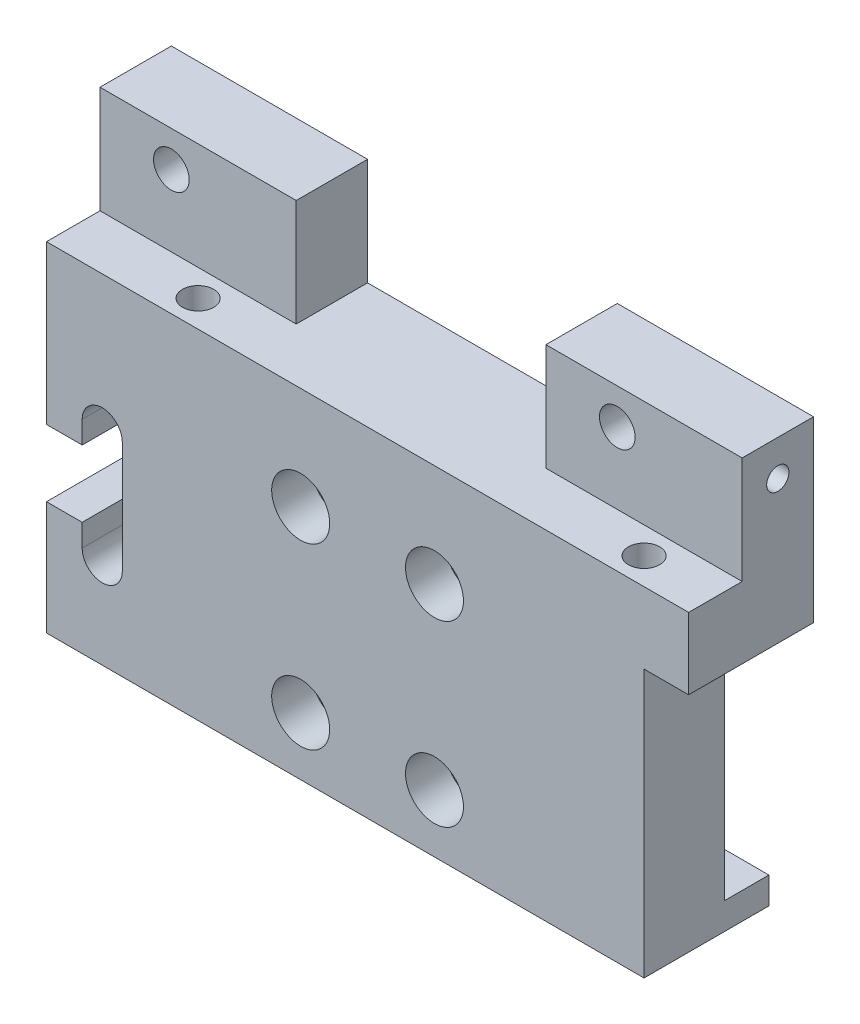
ISO-10303-21;
HEADER;
FILE_DESCRIPTION(('STEP AP214'),'2;1');
FILE_NAME('part.step','',(''),(''),'','','');
FILE_SCHEMA(('AUTOMOTIVE_DESIGN { 1 0 10303 214 1 1 1 1 }'));
ENDSEC;
DATA;
#1=APPLICATION_CONTEXT('core data for automotive mechanical design processes');
#2=APPLICATION_PROTOCOL_DEFINITION('international standard','automotive_design',2000,#1);
#3=PRODUCT_CONTEXT('',#1,'mechanical');
#4=PRODUCT('Part','Part','',(#3));
#5=PRODUCT_RELATED_PRODUCT_CATEGORY('part','',(#4));
#6=PRODUCT_DEFINITION_FORMATION('','',#4);
#7=PRODUCT_DEFINITION_CONTEXT('part definition',#1,'design');
#8=PRODUCT_DEFINITION('design','',#6,#7);
#9=PRODUCT_DEFINITION_SHAPE('','',#8);
#10=(LENGTH_UNIT() NAMED_UNIT(*) SI_UNIT(.MILLI.,.METRE.));
#11=(NAMED_UNIT(*) PLANE_ANGLE_UNIT() SI_UNIT($,.RADIAN.));
#12=(NAMED_UNIT(*) SI_UNIT($,.STERADIAN.) SOLID_ANGLE_UNIT());
#13=UNCERTAINTY_MEASURE_WITH_UNIT(LENGTH_MEASURE(1.E-05),#10,'distance_accuracy_value','');
#14=(GEOMETRIC_REPRESENTATION_CONTEXT(3) GLOBAL_UNCERTAINTY_ASSIGNED_CONTEXT((#13)) GLOBAL_UNIT_ASSIGNED_CONTEXT((#10,
#11,#12)) REPRESENTATION_CONTEXT('',''));
#15=CARTESIAN_POINT('',(0.,0.,0.));
#16=DIRECTION('',(0.,0.,1.));
#17=DIRECTION('',(1.,0.,0.));
#18=AXIS2_PLACEMENT_3D('',#15,#16,#17);
#19=CARTESIAN_POINT('',(6.25,22.7499999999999,14.));
#20=DIRECTION('',(0.,0.,1.));
#21=DIRECTION('',(1.,0.,0.));
#22=AXIS2_PLACEMENT_3D('',#19,#20,#21);
#23=PLANE('',#22);
#24=CARTESIAN_POINT('',(43.5,26.5,14.));
#25=DIRECTION('',(0.,0.,1.));
#26=DIRECTION('',(1.,0.,0.));
#27=AXIS2_PLACEMENT_3D('',#24,#25,#26);
#28=CIRCLE('',#27,3.25);
#29=CARTESIAN_POINT('',(46.75,26.5,14.));
#30=VERTEX_POINT('',#29);
#31=EDGE_CURVE('E545',#30,#30,#28,.T.);
#32=ORIENTED_EDGE('',*,*,#31,.F.);
#33=EDGE_LOOP('',(#32));
#34=FACE_BOUND('',#33,.T.);
#35=CARTESIAN_POINT('',(28.5,26.5,14.));
#36=DIRECTION('',(0.,0.,1.));
#37=DIRECTION('',(1.,0.,0.));
#38=AXIS2_PLACEMENT_3D('',#35,#36,#37);
#39=CIRCLE('',#38,3.25);
#40=CARTESIAN_POINT('',(31.75,26.5,14.));
#41=VERTEX_POINT('',#40);
#42=EDGE_CURVE('E336',#41,#41,#39,.T.);
#43=ORIENTED_EDGE('',*,*,#42,.F.);
#44=EDGE_LOOP('',(#43));
#45=FACE_BOUND('',#44,.T.);
#46=CARTESIAN_POINT('',(43.5,6.5,14.));
#47=DIRECTION('',(0.,0.,1.));
#48=DIRECTION('',(1.,0.,0.));
#49=AXIS2_PLACEMENT_3D('',#46,#47,#48);
#50=CIRCLE('',#49,3.25);
#51=CARTESIAN_POINT('',(46.75,6.5,14.));
#52=VERTEX_POINT('',#51);
#53=EDGE_CURVE('E331',#52,#52,#50,.T.);
#54=ORIENTED_EDGE('',*,*,#53,.F.);
#55=EDGE_LOOP('',(#54));
#56=FACE_BOUND('',#55,.T.);
#57=CARTESIAN_POINT('',(28.5,6.5,14.));
#58=DIRECTION('',(0.,0.,1.));
#59=DIRECTION('',(1.,0.,0.));
#60=AXIS2_PLACEMENT_3D('',#57,#58,#59);
#61=CIRCLE('',#60,3.25);
#62=CARTESIAN_POINT('',(31.75,6.5,14.));
#63=VERTEX_POINT('',#62);
#64=EDGE_CURVE('E326',#63,#63,#61,.T.);
#65=ORIENTED_EDGE('',*,*,#64,.F.);
#66=EDGE_LOOP('',(#65));
#67=FACE_BOUND('',#66,.T.);
#68=DIRECTION('',(-1.,0.,0.));
#69=VECTOR('',#68,1.);
#70=CARTESIAN_POINT('',(22.,37.9999999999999,14.));
#71=LINE('',#70,#69);
#72=CARTESIAN_POINT('',(72.,38.,14.));
#73=VERTEX_POINT('',#72);
#74=CARTESIAN_POINT('',(0.,38.,14.));
#75=VERTEX_POINT('',#74);
#76=EDGE_CURVE('E194',#73,#75,#71,.T.);
#77=ORIENTED_EDGE('',*,*,#76,.T.);
#78=DIRECTION('',(0.,-1.,0.));
#79=VECTOR('',#78,1.);
#80=CARTESIAN_POINT('',(0.,20.2499999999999,14.));
#81=LINE('',#80,#79);
#82=CARTESIAN_POINT('',(0.,20.2499999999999,14.));
#83=VERTEX_POINT('',#82);
#84=EDGE_CURVE('E197',#75,#83,#81,.T.);
#85=ORIENTED_EDGE('',*,*,#84,.T.);
#86=DIRECTION('',(1.,0.,0.));
#87=VECTOR('',#86,1.);
#88=CARTESIAN_POINT('',(0.,20.2499999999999,14.));
#89=LINE('',#88,#87);
#90=CARTESIAN_POINT('',(4.,20.2499999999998,14.));
#91=VERTEX_POINT('',#90);
#92=EDGE_CURVE('E220',#83,#91,#89,.T.);
#93=ORIENTED_EDGE('',*,*,#92,.T.);
#94=DIRECTION('',(0.,1.,0.));
#95=VECTOR('',#94,1.);
#96=CARTESIAN_POINT('',(4.,20.2499999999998,14.));
#97=LINE('',#96,#95);
#98=CARTESIAN_POINT('',(4.,22.7499999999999,14.));
#99=VERTEX_POINT('',#98);
#100=EDGE_CURVE('E222',#91,#99,#97,.T.);
#101=ORIENTED_EDGE('',*,*,#100,.T.);
#102=CARTESIAN_POINT('',(6.25,22.7499999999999,14.));
#103=DIRECTION('',(0.,0.,-1.));
#104=DIRECTION('',(1.,0.,0.));
#105=AXIS2_PLACEMENT_3D('',#102,#103,#104);
#106=CIRCLE('',#105,2.25);
#107=CARTESIAN_POINT('',(8.5,22.7499999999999,14.));
#108=VERTEX_POINT('',#107);
#109=EDGE_CURVE('E227',#99,#108,#106,.T.);
#110=ORIENTED_EDGE('',*,*,#109,.T.);
#111=DIRECTION('',(0.,-1.,0.));
#112=VECTOR('',#111,1.);
#113=CARTESIAN_POINT('',(8.5,10.2499999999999,14.));
#114=LINE('',#113,#112);
#115=CARTESIAN_POINT('',(8.5,10.2499999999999,14.));
#116=VERTEX_POINT('',#115);
#117=EDGE_CURVE('E229',#108,#116,#114,.T.);
#118=ORIENTED_EDGE('',*,*,#117,.T.);
#119=CARTESIAN_POINT('',(6.25,10.2499999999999,14.));
#120=DIRECTION('',(0.,0.,-1.));
#121=DIRECTION('',(1.,0.,0.));
#122=AXIS2_PLACEMENT_3D('',#119,#120,#121);
#123=CIRCLE('',#122,2.25);
#124=CARTESIAN_POINT('',(4.,10.2499999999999,14.));
#125=VERTEX_POINT('',#124);
#126=EDGE_CURVE('E231',#116,#125,#123,.T.);
#127=ORIENTED_EDGE('',*,*,#126,.T.);
#128=DIRECTION('',(0.,1.,0.));
#129=VECTOR('',#128,1.);
#130=CARTESIAN_POINT('',(4.,10.2499999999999,14.));
#131=LINE('',#130,#129);
#132=CARTESIAN_POINT('',(4.,12.7499999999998,14.));
#133=VERTEX_POINT('',#132);
#134=EDGE_CURVE('E233',#125,#133,#131,.T.);
#135=ORIENTED_EDGE('',*,*,#134,.T.);
#136=DIRECTION('',(-1.,0.,0.));
#137=VECTOR('',#136,1.);
#138=CARTESIAN_POINT('',(0.,12.7499999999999,14.));
#139=LINE('',#138,#137);
#140=CARTESIAN_POINT('',(0.,12.7499999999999,14.));
#141=VERTEX_POINT('',#140);
#142=EDGE_CURVE('E235',#133,#141,#139,.T.);
#143=ORIENTED_EDGE('',*,*,#142,.T.);
#144=DIRECTION('',(0.,-1.,0.));
#145=VECTOR('',#144,1.);
#146=CARTESIAN_POINT('',(0.,0.,14.));
#147=LINE('',#146,#145);
#148=CARTESIAN_POINT('',(0.,0.,14.));
#149=VERTEX_POINT('',#148);
#150=EDGE_CURVE('E237',#141,#149,#147,.T.);
#151=ORIENTED_EDGE('',*,*,#150,.T.);
#152=DIRECTION('',(1.,0.,0.));
#153=VECTOR('',#152,1.);
#154=CARTESIAN_POINT('',(0.,0.,14.));
#155=LINE('',#154,#153);
#156=CARTESIAN_POINT('',(67.,0.,14.));
#157=VERTEX_POINT('',#156);
#158=EDGE_CURVE('E273',#149,#157,#155,.T.);
#159=ORIENTED_EDGE('',*,*,#158,.T.);
#160=DIRECTION('',(0.,1.,0.));
#161=VECTOR('',#160,1.);
#162=CARTESIAN_POINT('',(67.,0.,14.));
#163=LINE('',#162,#161);
#164=CARTESIAN_POINT('',(67.,29.9999999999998,14.));
#165=VERTEX_POINT('',#164);
#166=EDGE_CURVE('E523',#157,#165,#163,.T.);
#167=ORIENTED_EDGE('',*,*,#166,.T.);
#168=DIRECTION('',(1.,0.,0.));
#169=VECTOR('',#168,1.);
#170=CARTESIAN_POINT('',(67.,29.9999999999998,14.));
#171=LINE('',#170,#169);
#172=CARTESIAN_POINT('',(72.,30.,14.));
#173=VERTEX_POINT('',#172);
#174=EDGE_CURVE('E522',#165,#173,#171,.T.);
#175=ORIENTED_EDGE('',*,*,#174,.T.);
#176=DIRECTION('',(0.,1.,0.));
#177=VECTOR('',#176,1.);
#178=CARTESIAN_POINT('',(72.,30.,14.));
#179=LINE('',#178,#177);
#180=EDGE_CURVE('E200',#173,#73,#179,.T.);
#181=ORIENTED_EDGE('',*,*,#180,.T.);
#182=EDGE_LOOP('',(#77,#85,#93,#101,#110,#118,#127,#135,#143,#151,#159,#167,#175,#181));
#183=FACE_BOUND('',#182,.T.);
#184=ADVANCED_FACE('F34',(#34,#45,#56,#67,#183),#23,.T.);
#185=CARTESIAN_POINT('',(6.25,22.7499999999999,0.));
#186=DIRECTION('',(0.,0.,1.));
#187=DIRECTION('',(1.,0.,0.));
#188=AXIS2_PLACEMENT_3D('',#185,#186,#187);
#189=PLANE('',#188);
#190=DIRECTION('',(0.,-1.,0.));
#191=VECTOR('',#190,1.);
#192=CARTESIAN_POINT('',(0.,0.,0.));
#193=LINE('',#192,#191);
#194=CARTESIAN_POINT('',(0.,3.,0.));
#195=VERTEX_POINT('',#194);
#196=CARTESIAN_POINT('',(0.,0.,0.));
#197=VERTEX_POINT('',#196);
#198=EDGE_CURVE('E271',#195,#197,#193,.T.);
#199=ORIENTED_EDGE('',*,*,#198,.F.);
#200=DIRECTION('',(1.,0.,0.));
#201=VECTOR('',#200,1.);
#202=CARTESIAN_POINT('',(0.,3.,0.));
#203=LINE('',#202,#201);
#204=CARTESIAN_POINT('',(67.,3.,0.));
#205=VERTEX_POINT('',#204);
#206=EDGE_CURVE('E579',#195,#205,#203,.T.);
#207=ORIENTED_EDGE('',*,*,#206,.T.);
#208=DIRECTION('',(0.,1.,0.));
#209=VECTOR('',#208,1.);
#210=CARTESIAN_POINT('',(67.,0.,0.));
#211=LINE('',#210,#209);
#212=CARTESIAN_POINT('',(67.,0.,0.));
#213=VERTEX_POINT('',#212);
#214=EDGE_CURVE('E243',#213,#205,#211,.T.);
#215=ORIENTED_EDGE('',*,*,#214,.F.);
#216=DIRECTION('',(1.,0.,0.));
#217=VECTOR('',#216,1.);
#218=CARTESIAN_POINT('',(0.,0.,0.));
#219=LINE('',#218,#217);
#220=EDGE_CURVE('E240',#197,#213,#219,.T.);
#221=ORIENTED_EDGE('',*,*,#220,.F.);
#222=EDGE_LOOP('',(#199,#207,#215,#221));
#223=FACE_BOUND('',#222,.T.);
#224=ADVANCED_FACE('F424',(#223),#189,.F.);
#225=CARTESIAN_POINT('',(72.,30.,14.));
#226=DIRECTION('',(-1.,0.,0.));
#227=DIRECTION('',(0.,0.,1.));
#228=AXIS2_PLACEMENT_3D('',#225,#226,#227);
#229=PLANE('',#228);
#230=CARTESIAN_POINT('',(72.,46.0000000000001,4.00000000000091));
#231=DIRECTION('',(1.,0.,0.));
#232=DIRECTION('',(0.,0.,-1.));
#233=AXIS2_PLACEMENT_3D('',#230,#231,#232);
#234=CIRCLE('',#233,1.25);
#235=CARTESIAN_POINT('',(72.,46.0000000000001,2.75000000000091));
#236=VERTEX_POINT('',#235);
#237=EDGE_CURVE('E346',#236,#236,#234,.T.);
#238=ORIENTED_EDGE('',*,*,#237,.F.);
#239=EDGE_LOOP('',(#238));
#240=FACE_BOUND('',#239,.T.);
#241=DIRECTION('',(0.,1.,0.));
#242=VECTOR('',#241,1.);
#243=CARTESIAN_POINT('',(72.,25.0000000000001,8.));
#244=LINE('',#243,#242);
#245=CARTESIAN_POINT('',(72.,38.,8.));
#246=VERTEX_POINT('',#245);
#247=CARTESIAN_POINT('',(72.,50.,8.));
#248=VERTEX_POINT('',#247);
#249=EDGE_CURVE('E213',#246,#248,#244,.T.);
#250=ORIENTED_EDGE('',*,*,#249,.F.);
#251=DIRECTION('',(0.,0.,-1.));
#252=VECTOR('',#251,1.);
#253=CARTESIAN_POINT('',(72.,38.,-33.5280528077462));
#254=LINE('',#253,#252);
#255=EDGE_CURVE('E345',#73,#246,#254,.T.);
#256=ORIENTED_EDGE('',*,*,#255,.F.);
#257=ORIENTED_EDGE('',*,*,#180,.F.);
#258=DIRECTION('',(0.,0.,-1.));
#259=VECTOR('',#258,1.);
#260=CARTESIAN_POINT('',(72.,30.,14.));
#261=LINE('',#260,#259);
#262=CARTESIAN_POINT('',(72.,30.,0.));
#263=VERTEX_POINT('',#262);
#264=EDGE_CURVE('E310',#173,#263,#261,.T.);
#265=ORIENTED_EDGE('',*,*,#264,.T.);
#266=DIRECTION('',(0.,1.,0.));
#267=VECTOR('',#266,1.);
#268=CARTESIAN_POINT('',(72.,30.,0.));
#269=LINE('',#268,#267);
#270=CARTESIAN_POINT('',(72.,50.,0.));
#271=VERTEX_POINT('',#270);
#272=EDGE_CURVE('E250',#263,#271,#269,.T.);
#273=ORIENTED_EDGE('',*,*,#272,.T.);
#274=DIRECTION('',(0.,0.,-1.));
#275=VECTOR('',#274,1.);
#276=CARTESIAN_POINT('',(72.,50.,14.));
#277=LINE('',#276,#275);
#278=EDGE_CURVE('E308',#248,#271,#277,.T.);
#279=ORIENTED_EDGE('',*,*,#278,.F.);
#280=EDGE_LOOP('',(#250,#256,#257,#265,#273,#279));
#281=FACE_BOUND('',#280,.T.);
#282=ADVANCED_FACE('F433',(#240,#281),#229,.F.);
#283=CARTESIAN_POINT('',(50.,50.,14.));
#284=DIRECTION('',(0.,-1.,0.));
#285=DIRECTION('',(0.,0.,-1.));
#286=AXIS2_PLACEMENT_3D('',#283,#284,#285);
#287=PLANE('',#286);
#288=DIRECTION('',(0.,0.,-1.));
#289=VECTOR('',#288,1.);
#290=CARTESIAN_POINT('',(50.,50.,14.));
#291=LINE('',#290,#289);
#292=CARTESIAN_POINT('',(50.,50.,8.));
#293=VERTEX_POINT('',#292);
#294=CARTESIAN_POINT('',(50.,50.,0.));
#295=VERTEX_POINT('',#294);
#296=EDGE_CURVE('E306',#293,#295,#291,.T.);
#297=ORIENTED_EDGE('',*,*,#296,.F.);
#298=DIRECTION('',(1.,0.,0.));
#299=VECTOR('',#298,1.);
#300=CARTESIAN_POINT('',(0.,50.,8.));
#301=LINE('',#300,#299);
#302=EDGE_CURVE('E55',#293,#248,#301,.T.);
#303=ORIENTED_EDGE('',*,*,#302,.T.);
#304=ORIENTED_EDGE('',*,*,#278,.T.);
#305=DIRECTION('',(-1.,0.,0.));
#306=VECTOR('',#305,1.);
#307=CARTESIAN_POINT('',(50.,50.,0.));
#308=LINE('',#307,#306);
#309=EDGE_CURVE('E253',#271,#295,#308,.T.);
#310=ORIENTED_EDGE('',*,*,#309,.T.);
#311=EDGE_LOOP('',(#297,#303,#304,#310));
#312=FACE_BOUND('',#311,.T.);
#313=ADVANCED_FACE('F489',(#312),#287,.F.);
#314=CARTESIAN_POINT('',(50.,37.9999999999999,14.));
#315=DIRECTION('',(1.,0.,0.));
#316=DIRECTION('',(0.,0.,-1.));
#317=AXIS2_PLACEMENT_3D('',#314,#315,#316);
#318=PLANE('',#317);
#319=DIRECTION('',(0.,0.,-1.));
#320=VECTOR('',#319,1.);
#321=CARTESIAN_POINT('',(50.,37.9999999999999,14.));
#322=LINE('',#321,#320);
#323=CARTESIAN_POINT('',(50.,38.,8.));
#324=VERTEX_POINT('',#323);
#325=CARTESIAN_POINT('',(50.,37.9999999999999,0.));
#326=VERTEX_POINT('',#325);
#327=EDGE_CURVE('E304',#324,#326,#322,.T.);
#328=ORIENTED_EDGE('',*,*,#327,.F.);
#329=DIRECTION('',(0.,1.,0.));
#330=VECTOR('',#329,1.);
#331=CARTESIAN_POINT('',(50.,37.9999999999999,8.));
#332=LINE('',#331,#330);
#333=EDGE_CURVE('E574',#324,#293,#332,.T.);
#334=ORIENTED_EDGE('',*,*,#333,.T.);
#335=ORIENTED_EDGE('',*,*,#296,.T.);
#336=DIRECTION('',(0.,-1.,0.));
#337=VECTOR('',#336,1.);
#338=CARTESIAN_POINT('',(50.,37.9999999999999,0.));
#339=LINE('',#338,#337);
#340=EDGE_CURVE('E256',#295,#326,#339,.T.);
#341=ORIENTED_EDGE('',*,*,#340,.T.);
#342=EDGE_LOOP('',(#328,#334,#335,#341));
#343=FACE_BOUND('',#342,.T.);
#344=ADVANCED_FACE('F481',(#343),#318,.F.);
#345=CARTESIAN_POINT('',(22.,37.9999999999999,14.));
#346=DIRECTION('',(-1.,0.,0.));
#347=DIRECTION('',(0.,0.,1.));
#348=AXIS2_PLACEMENT_3D('',#345,#346,#347);
#349=PLANE('',#348);
#350=DIRECTION('',(0.,0.,-1.));
#351=VECTOR('',#350,1.);
#352=CARTESIAN_POINT('',(22.,50.,14.));
#353=LINE('',#352,#351);
#354=CARTESIAN_POINT('',(22.,50.,8.));
#355=VERTEX_POINT('',#354);
#356=CARTESIAN_POINT('',(22.,50.,0.));
#357=VERTEX_POINT('',#356);
#358=EDGE_CURVE('E300',#355,#357,#353,.T.);
#359=ORIENTED_EDGE('',*,*,#358,.F.);
#360=DIRECTION('',(0.,-1.,0.));
#361=VECTOR('',#360,1.);
#362=CARTESIAN_POINT('',(22.,37.9999999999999,8.));
#363=LINE('',#362,#361);
#364=CARTESIAN_POINT('',(22.,38.,8.));
#365=VERTEX_POINT('',#364);
#366=EDGE_CURVE('E576',#355,#365,#363,.T.);
#367=ORIENTED_EDGE('',*,*,#366,.T.);
#368=DIRECTION('',(0.,0.,-1.));
#369=VECTOR('',#368,1.);
#370=CARTESIAN_POINT('',(22.,37.9999999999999,14.));
#371=LINE('',#370,#369);
#372=CARTESIAN_POINT('',(22.,37.9999999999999,0.));
#373=VERTEX_POINT('',#372);
#374=EDGE_CURVE('E302',#365,#373,#371,.T.);
#375=ORIENTED_EDGE('',*,*,#374,.T.);
#376=DIRECTION('',(0.,1.,0.));
#377=VECTOR('',#376,1.);
#378=CARTESIAN_POINT('',(22.,37.9999999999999,0.));
#379=LINE('',#378,#377);
#380=EDGE_CURVE('E262',#373,#357,#379,.T.);
#381=ORIENTED_EDGE('',*,*,#380,.T.);
#382=EDGE_LOOP('',(#359,#367,#375,#381));
#383=FACE_BOUND('',#382,.T.);
#384=ADVANCED_FACE('F477',(#383),#349,.F.);
#385=CARTESIAN_POINT('',(0.,50.,14.));
#386=DIRECTION('',(0.,-1.,0.));
#387=DIRECTION('',(0.,0.,-1.));
#388=AXIS2_PLACEMENT_3D('',#385,#386,#387);
#389=PLANE('',#388);
#390=DIRECTION('',(0.,0.,-1.));
#391=VECTOR('',#390,1.);
#392=CARTESIAN_POINT('',(0.,50.,14.));
#393=LINE('',#392,#391);
#394=CARTESIAN_POINT('',(0.,50.,8.));
#395=VERTEX_POINT('',#394);
#396=CARTESIAN_POINT('',(0.,50.,0.));
#397=VERTEX_POINT('',#396);
#398=EDGE_CURVE('E298',#395,#397,#393,.T.);
#399=ORIENTED_EDGE('',*,*,#398,.F.);
#400=EDGE_CURVE('E63',#395,#355,#301,.T.);
#401=ORIENTED_EDGE('',*,*,#400,.T.);
#402=ORIENTED_EDGE('',*,*,#358,.T.);
#403=DIRECTION('',(-1.,0.,0.));
#404=VECTOR('',#403,1.);
#405=CARTESIAN_POINT('',(0.,50.,0.));
#406=LINE('',#405,#404);
#407=EDGE_CURVE('E265',#357,#397,#406,.T.);
#408=ORIENTED_EDGE('',*,*,#407,.T.);
#409=EDGE_LOOP('',(#399,#401,#402,#408));
#410=FACE_BOUND('',#409,.T.);
#411=ADVANCED_FACE('F473',(#410),#389,.F.);
#412=CARTESIAN_POINT('',(0.,20.2499999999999,14.));
#413=DIRECTION('',(1.,0.,0.));
#414=DIRECTION('',(0.,0.,-1.));
#415=AXIS2_PLACEMENT_3D('',#412,#413,#414);
#416=PLANE('',#415);
#417=CARTESIAN_POINT('',(0.,46.,4.));
#418=DIRECTION('',(-1.,0.,0.));
#419=DIRECTION('',(0.,0.,1.));
#420=AXIS2_PLACEMENT_3D('',#417,#418,#419);
#421=CIRCLE('',#420,1.5);
#422=CARTESIAN_POINT('',(0.,46.,5.5));
#423=VERTEX_POINT('',#422);
#424=EDGE_CURVE('E601',#423,#423,#421,.T.);
#425=ORIENTED_EDGE('',*,*,#424,.F.);
#426=EDGE_LOOP('',(#425));
#427=FACE_BOUND('',#426,.T.);
#428=ORIENTED_EDGE('',*,*,#84,.F.);
#429=DIRECTION('',(0.,0.,-1.));
#430=VECTOR('',#429,1.);
#431=CARTESIAN_POINT('',(0.,38.,-33.5280528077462));
#432=LINE('',#431,#430);
#433=CARTESIAN_POINT('',(0.,38.,8.));
#434=VERTEX_POINT('',#433);
#435=EDGE_CURVE('E207',#75,#434,#432,.T.);
#436=ORIENTED_EDGE('',*,*,#435,.T.);
#437=DIRECTION('',(0.,1.,0.));
#438=VECTOR('',#437,1.);
#439=CARTESIAN_POINT('',(0.,25.0000000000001,8.));
#440=LINE('',#439,#438);
#441=EDGE_CURVE('E583',#434,#395,#440,.T.);
#442=ORIENTED_EDGE('',*,*,#441,.T.);
#443=ORIENTED_EDGE('',*,*,#398,.T.);
#444=DIRECTION('',(0.,-1.,0.));
#445=VECTOR('',#444,1.);
#446=CARTESIAN_POINT('',(0.,20.2499999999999,0.));
#447=LINE('',#446,#445);
#448=CARTESIAN_POINT('',(0.,30.,0.));
#449=VERTEX_POINT('',#448);
#450=EDGE_CURVE('E268',#397,#449,#447,.T.);
#451=ORIENTED_EDGE('',*,*,#450,.T.);
#452=DIRECTION('',(0.,0.,-1.));
#453=VECTOR('',#452,1.);
#454=CARTESIAN_POINT('',(0.,30.,-33.5280528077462));
#455=LINE('',#454,#453);
#456=CARTESIAN_POINT('',(0.,30.,5.));
#457=VERTEX_POINT('',#456);
#458=EDGE_CURVE('E592',#457,#449,#455,.T.);
#459=ORIENTED_EDGE('',*,*,#458,.F.);
#460=DIRECTION('',(0.,1.,0.));
#461=VECTOR('',#460,1.);
#462=CARTESIAN_POINT('',(0.,25.0000000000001,5.));
#463=LINE('',#462,#461);
#464=CARTESIAN_POINT('',(0.,20.2499999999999,5.));
#465=VERTEX_POINT('',#464);
#466=EDGE_CURVE('E596',#465,#457,#463,.T.);
#467=ORIENTED_EDGE('',*,*,#466,.F.);
#468=DIRECTION('',(0.,0.,-1.));
#469=VECTOR('',#468,1.);
#470=CARTESIAN_POINT('',(0.,20.2499999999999,14.));
#471=LINE('',#470,#469);
#472=EDGE_CURVE('E218',#83,#465,#471,.T.);
#473=ORIENTED_EDGE('',*,*,#472,.F.);
#474=EDGE_LOOP('',(#428,#436,#442,#443,#451,#459,#467,#473));
#475=FACE_BOUND('',#474,.T.);
#476=ADVANCED_FACE('F215',(#427,#475),#416,.F.);
#477=CARTESIAN_POINT('',(8.,46.,14.));
#478=DIRECTION('',(0.,0.,-1.));
#479=DIRECTION('',(-1.,0.,0.));
#480=AXIS2_PLACEMENT_3D('',#477,#478,#479);
#481=CYLINDRICAL_SURFACE('',#480,2.);
#482=CARTESIAN_POINT('',(6.,46.,5.5));
#483=CARTESIAN_POINT('',(6.00000459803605,45.9267792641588,5.49999520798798));
#484=CARTESIAN_POINT('',(6.00406354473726,45.8534389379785,5.4945949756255));
#485=CARTESIAN_POINT('',(6.01993392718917,45.7090636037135,5.47333293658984));
#486=CARTESIAN_POINT('',(6.03176485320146,45.638034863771,5.45744482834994));
#487=CARTESIAN_POINT('',(6.0620432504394,45.5007653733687,5.41628709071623));
#488=CARTESIAN_POINT('',(6.08045048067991,45.4344983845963,5.39107448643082));
#489=CARTESIAN_POINT('',(6.12249443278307,45.3075776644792,5.33245765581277));
#490=CARTESIAN_POINT('',(6.14612962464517,45.2469222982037,5.29905582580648));
#491=CARTESIAN_POINT('',(6.19950455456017,45.1265340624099,5.22173698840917));
#492=CARTESIAN_POINT('',(6.22960691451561,45.067406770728,5.17713267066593));
#493=CARTESIAN_POINT('',(6.29232982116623,44.9569728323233,5.08050416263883));
#494=CARTESIAN_POINT('',(6.32495421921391,44.9056785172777,5.02846851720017));
#495=CARTESIAN_POINT('',(6.3972887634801,44.8016283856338,4.90641704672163));
#496=CARTESIAN_POINT('',(6.43709145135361,44.750694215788,4.8348963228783));
#497=CARTESIAN_POINT('',(6.51288555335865,44.6613800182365,4.68254898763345));
#498=CARTESIAN_POINT('',(6.54888213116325,44.6229828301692,4.60173530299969));
#499=CARTESIAN_POINT('',(6.60022844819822,44.5711937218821,4.46049716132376));
#500=CARTESIAN_POINT('',(6.61842248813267,44.5537432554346,4.40260930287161));
#501=CARTESIAN_POINT('',(6.64828405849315,44.5257932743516,4.28360726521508));
#502=CARTESIAN_POINT('',(6.65996652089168,44.5152778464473,4.22250082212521));
#503=CARTESIAN_POINT('',(6.67496240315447,44.5018717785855,4.09781741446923));
#504=CARTESIAN_POINT('',(6.67819973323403,44.4990504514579,4.03422319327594));
#505=CARTESIAN_POINT('',(6.67540468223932,44.5015178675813,3.90738508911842));
#506=CARTESIAN_POINT('',(6.66936897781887,44.5068095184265,3.84414133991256));
#507=CARTESIAN_POINT('',(6.65032376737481,44.5240226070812,3.72680865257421));
#508=CARTESIAN_POINT('',(6.63812842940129,44.5351751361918,3.67246362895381));
#509=CARTESIAN_POINT('',(6.60885807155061,44.5629432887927,3.56656112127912));
#510=CARTESIAN_POINT('',(6.59177836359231,44.5795641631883,3.5150063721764));
#511=CARTESIAN_POINT('',(6.54258230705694,44.6296693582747,3.38374361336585));
#512=CARTESIAN_POINT('',(6.50774350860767,44.6671985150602,3.30659958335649));
#513=CARTESIAN_POINT('',(6.43466701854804,44.7538197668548,3.16080347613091));
#514=CARTESIAN_POINT('',(6.3964212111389,44.8029399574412,3.09217266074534));
#515=CARTESIAN_POINT('',(6.31948327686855,44.9134839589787,2.96224660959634));
#516=CARTESIAN_POINT('',(6.2808041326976,44.9751862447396,2.90117939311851));
#517=CARTESIAN_POINT('',(6.20751962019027,45.1095774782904,2.78973635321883));
#518=CARTESIAN_POINT('',(6.1729065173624,45.1822449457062,2.73934007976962));
#519=CARTESIAN_POINT('',(6.11720273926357,45.3220979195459,2.66001920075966));
#520=CARTESIAN_POINT('',(6.09479229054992,45.3874601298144,2.62881540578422));
#521=CARTESIAN_POINT('',(6.05627095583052,45.5236478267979,2.57577511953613));
#522=CARTESIAN_POINT('',(6.04015612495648,45.5944698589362,2.55393276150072));
#523=CARTESIAN_POINT('',(6.01554411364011,45.7403237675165,2.52074663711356));
#524=CARTESIAN_POINT('',(6.00709407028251,45.8153787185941,2.50946782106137));
#525=CARTESIAN_POINT('',(5.99884116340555,45.9667987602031,2.49845040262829));
#526=CARTESIAN_POINT('',(5.99903465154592,46.0431632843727,2.49870693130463));
#527=CARTESIAN_POINT('',(6.00757452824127,46.1868042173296,2.51011086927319));
#528=CARTESIAN_POINT('',(6.01509913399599,46.2542223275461,2.52016053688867));
#529=CARTESIAN_POINT('',(6.03648679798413,46.3861106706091,2.54897378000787));
#530=CARTESIAN_POINT('',(6.05035120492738,46.4505802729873,2.56773920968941));
#531=CARTESIAN_POINT('',(6.08400169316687,46.5774167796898,2.6138875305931));
#532=CARTESIAN_POINT('',(6.10397949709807,46.6396291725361,2.6415511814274));
#533=CARTESIAN_POINT('',(6.14833014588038,46.7585185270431,2.70417245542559));
#534=CARTESIAN_POINT('',(6.17270359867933,46.8151947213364,2.73913108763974));
#535=CARTESIAN_POINT('',(6.22880853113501,46.931511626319,2.82178324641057));
#536=CARTESIAN_POINT('',(6.26108904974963,46.9900667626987,2.87062853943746));
#537=CARTESIAN_POINT('',(6.32761047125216,47.0987197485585,2.9760087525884));
#538=CARTESIAN_POINT('',(6.36185561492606,47.1487983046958,3.03256069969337));
#539=CARTESIAN_POINT('',(6.43630871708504,47.2487754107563,3.16414988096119));
#540=CARTESIAN_POINT('',(6.476412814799,47.2968304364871,3.24065756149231));
#541=CARTESIAN_POINT('',(6.5505940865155,47.3792323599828,3.40336007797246));
#542=CARTESIAN_POINT('',(6.58468900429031,47.4136200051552,3.48952512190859));
#543=CARTESIAN_POINT('',(6.62881122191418,47.4561573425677,3.63541444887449));
#544=CARTESIAN_POINT('',(6.64304188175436,47.46931009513,3.69239112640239));
#545=CARTESIAN_POINT('',(6.6645794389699,47.4889152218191,3.80870704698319));
#546=CARTESIAN_POINT('',(6.67190178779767,47.4953825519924,3.86804070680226));
#547=CARTESIAN_POINT('',(6.67842398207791,47.5011532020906,3.98782907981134));
#548=CARTESIAN_POINT('',(6.67758259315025,47.5004201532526,4.04828794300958));
#549=CARTESIAN_POINT('',(6.66783551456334,47.4917688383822,4.16805683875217));
#550=CARTESIAN_POINT('',(6.65891941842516,47.4838413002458,4.22736528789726));
#551=CARTESIAN_POINT('',(6.63182651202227,47.4589384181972,4.35591457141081));
#552=CARTESIAN_POINT('',(6.61205294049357,47.4403656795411,4.42449718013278));
#553=CARTESIAN_POINT('',(6.5661703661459,47.3946962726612,4.55653484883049));
#554=CARTESIAN_POINT('',(6.5400453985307,47.3675780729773,4.6199764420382));
#555=CARTESIAN_POINT('',(6.47483522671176,47.2949891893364,4.76252063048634));
#556=CARTESIAN_POINT('',(6.43439796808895,47.2464154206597,4.83942158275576));
#557=CARTESIAN_POINT('',(6.35286489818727,47.1365071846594,4.98312604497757));
#558=CARTESIAN_POINT('',(6.31176853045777,47.0751613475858,5.04992046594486));
#559=CARTESIAN_POINT('',(6.23271011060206,46.9396271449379,5.17283184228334));
#560=CARTESIAN_POINT('',(6.19477666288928,46.8653371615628,5.2288563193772));
#561=CARTESIAN_POINT('',(6.12642710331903,46.7051590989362,5.32722305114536));
#562=CARTESIAN_POINT('',(6.09599308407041,46.6192994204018,5.36959797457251));
#563=CARTESIAN_POINT('',(6.05363295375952,46.4648402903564,5.42779942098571));
#564=CARTESIAN_POINT('',(6.03889677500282,46.3985536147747,5.44776673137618));
#565=CARTESIAN_POINT('',(6.01616260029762,46.2628416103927,5.47841790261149));
#566=CARTESIAN_POINT('',(6.00814578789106,46.1934256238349,5.48912769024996));
#567=CARTESIAN_POINT('',(6.00254528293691,46.1029633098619,5.49660469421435));
#568=CARTESIAN_POINT('',(6.0015923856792,46.0824069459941,5.49787627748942));
#569=CARTESIAN_POINT('',(6.00031904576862,46.0412368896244,5.49957467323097));
#570=CARTESIAN_POINT('',(5.99999870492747,46.0206231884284,5.50000134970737));
#571=CARTESIAN_POINT('',(6.,46.,5.5));
#572=B_SPLINE_CURVE_WITH_KNOTS('',3,(#482,#483,#484,#485,#486,#487,#488,#489,#490,#491,#492,
#493,#494,#495,#496,#497,#498,#499,#500,#501,#502,#503,#504,#505,#506,#507,#508,#509,#510,#511,
#512,#513,#514,#515,#516,#517,#518,#519,#520,#521,#522,#523,#524,#525,#526,#527,#528,#529,#530,
#531,#532,#533,#534,#535,#536,#537,#538,#539,#540,#541,#542,#543,#544,#545,#546,#547,#548,#549,
#550,#551,#552,#553,#554,#555,#556,#557,#558,#559,#560,#561,#562,#563,#564,#565,#566,#567,#568,
#569,#570,#571),.UNSPECIFIED.,.T.,.F.,(4,2,2,2,2,2,2,2,2,2,2,2,2,2,2,2,2,2,2,2,2,2,2,2,2,2,2,2,
2,2,2,2,2,2,2,2,2,2,2,2,2,2,2,2,4),(0.,0.219571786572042,0.439696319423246,0.658496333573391,
0.877232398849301,1.1162243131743,1.35558868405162,1.64360015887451,1.93121574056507,
2.11999518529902,2.30833993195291,2.49837587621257,2.6884799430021,2.85826890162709,
3.0282213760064,3.30449331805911,3.5814419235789,3.86535883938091,4.14872662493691,
4.3752650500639,4.60166129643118,4.82944058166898,5.05712372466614,5.26191187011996,
5.46674360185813,5.6788043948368,5.89089453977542,6.13840382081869,6.38646908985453,
6.68168596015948,6.97601595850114,7.15589161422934,7.33536399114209,7.51574333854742,
7.69635548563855,7.91639670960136,8.13699685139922,8.43412246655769,8.73151372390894,
9.03135449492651,9.33047220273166,9.54195697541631,9.75284752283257,9.81468166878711,
9.87652576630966),.UNSPECIFIED.);
#573=CARTESIAN_POINT('',(6.,46.,5.5));
#574=VERTEX_POINT('',#573);
#575=EDGE_CURVE('E38',#574,#574,#572,.T.);
#576=ORIENTED_EDGE('',*,*,#575,.F.);
#577=EDGE_LOOP('',(#576));
#578=FACE_BOUND('',#577,.T.);
#579=CARTESIAN_POINT('',(8.,46.,0.));
#580=DIRECTION('',(0.,0.,1.));
#581=DIRECTION('',(1.,0.,0.));
#582=AXIS2_PLACEMENT_3D('',#579,#580,#581);
#583=CIRCLE('',#582,2.);
#584=CARTESIAN_POINT('',(10.,46.,0.));
#585=VERTEX_POINT('',#584);
#586=EDGE_CURVE('E244',#585,#585,#583,.T.);
#587=ORIENTED_EDGE('',*,*,#586,.F.);
#588=EDGE_LOOP('',(#587));
#589=FACE_BOUND('',#588,.T.);
#590=CARTESIAN_POINT('',(8.,46.,8.));
#591=DIRECTION('',(0.,0.,-1.));
#592=DIRECTION('',(-1.,0.,0.));
#593=AXIS2_PLACEMENT_3D('',#590,#591,#592);
#594=CIRCLE('',#593,2.);
#595=CARTESIAN_POINT('',(6.,46.,8.));
#596=VERTEX_POINT('',#595);
#597=EDGE_CURVE('E11',#596,#596,#594,.T.);
#598=ORIENTED_EDGE('',*,*,#597,.F.);
#599=EDGE_LOOP('',(#598));
#600=FACE_BOUND('',#599,.T.);
#601=ADVANCED_FACE('F437',(#578,#589,#600),#481,.F.);
#602=CARTESIAN_POINT('',(58.,46.,14.));
#603=DIRECTION('',(0.,0.,-1.));
#604=DIRECTION('',(-1.,0.,0.));
#605=AXIS2_PLACEMENT_3D('',#602,#603,#604);
#606=CYLINDRICAL_SURFACE('',#605,2.);
#607=CARTESIAN_POINT('',(60.,46.0000000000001,2.75000000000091));
#608=CARTESIAN_POINT('',(59.9999959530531,45.9364895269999,2.75000434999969));
#609=CARTESIAN_POINT('',(59.99694323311,45.8729035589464,2.75487301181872));
#610=CARTESIAN_POINT('',(59.985021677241,45.7476817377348,2.77408580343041));
#611=CARTESIAN_POINT('',(59.976141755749,45.6860498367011,2.78844799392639));
#612=CARTESIAN_POINT('',(59.9534585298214,45.5667944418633,2.82581136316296));
#613=CARTESIAN_POINT('',(59.9396796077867,45.5091527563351,2.84876978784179));
#614=CARTESIAN_POINT('',(59.9083459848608,45.3987396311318,2.90238585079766));
#615=CARTESIAN_POINT('',(59.8907917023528,45.345967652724,2.93304263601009));
#616=CARTESIAN_POINT('',(59.8517015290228,45.2420258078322,3.00388657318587));
#617=CARTESIAN_POINT('',(59.8299596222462,45.1913204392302,3.04463929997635));
#618=CARTESIAN_POINT('',(59.7853134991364,45.0970136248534,3.13321917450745));
#619=CARTESIAN_POINT('',(59.7624077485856,45.0534218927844,3.18105582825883));
#620=CARTESIAN_POINT('',(59.7143041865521,44.9685712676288,3.29003389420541));
#621=CARTESIAN_POINT('',(59.6892161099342,44.9284279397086,3.35209978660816));
#622=CARTESIAN_POINT('',(59.6433019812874,44.8592603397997,3.48356481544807));
#623=CARTESIAN_POINT('',(59.6224687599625,44.8302172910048,3.55295131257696));
#624=CARTESIAN_POINT('',(59.5930957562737,44.7906659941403,3.6788105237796));
#625=CARTESIAN_POINT('',(59.5827690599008,44.7773044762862,3.7339668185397));
#626=CARTESIAN_POINT('',(59.5678135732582,44.7581815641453,3.84630592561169));
#627=CARTESIAN_POINT('',(59.563176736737,44.7524094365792,3.90348575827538));
#628=CARTESIAN_POINT('',(59.5602988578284,44.7488108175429,4.01841301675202));
#629=CARTESIAN_POINT('',(59.5620745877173,44.7510051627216,4.0761615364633));
#630=CARTESIAN_POINT('',(59.5717740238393,44.7632368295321,4.19031010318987));
#631=CARTESIAN_POINT('',(59.5797026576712,44.7732804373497,4.24670903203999));
#632=CARTESIAN_POINT('',(59.6003257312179,44.8003189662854,4.3554384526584));
#633=CARTESIAN_POINT('',(59.6129071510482,44.8171498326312,4.40783245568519));
#634=CARTESIAN_POINT('',(59.6414556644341,44.8570981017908,4.50916118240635));
#635=CARTESIAN_POINT('',(59.6574239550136,44.8802177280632,4.55809467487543));
#636=CARTESIAN_POINT('',(59.6945481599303,44.9370510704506,4.66083327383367));
#637=CARTESIAN_POINT('',(59.7161159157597,44.9719370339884,4.71384081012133));
#638=CARTESIAN_POINT('',(59.7600571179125,45.049118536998,4.81383027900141));
#639=CARTESIAN_POINT('',(59.7824313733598,45.0914216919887,4.86080593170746));
#640=CARTESIAN_POINT('',(59.8297989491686,45.1904802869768,4.95530174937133));
#641=CARTESIAN_POINT('',(59.854615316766,45.2484686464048,5.00163297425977));
#642=CARTESIAN_POINT('',(59.9002805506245,45.3728519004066,5.08385089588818));
#643=CARTESIAN_POINT('',(59.9211309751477,45.4392434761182,5.11974169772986));
#644=CARTESIAN_POINT('',(59.9555337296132,45.5751164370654,5.17776368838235));
#645=CARTESIAN_POINT('',(59.9694197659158,45.6442365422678,5.2005340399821));
#646=CARTESIAN_POINT('',(59.9898492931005,45.7863878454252,5.23376492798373));
#647=CARTESIAN_POINT('',(59.9964031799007,45.8594133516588,5.24424289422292));
#648=CARTESIAN_POINT('',(60.0009784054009,45.9954843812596,5.25156585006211));
#649=CARTESIAN_POINT('',(60.0001216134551,46.0584027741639,5.25020317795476));
#650=CARTESIAN_POINT('',(59.9925890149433,46.1829721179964,5.23811717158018));
#651=CARTESIAN_POINT('',(59.9859136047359,46.2446231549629,5.22739447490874));
#652=CARTESIAN_POINT('',(59.9677405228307,46.3625210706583,5.19776146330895));
#653=CARTESIAN_POINT('',(59.9564417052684,46.4188850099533,5.17918784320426));
#654=CARTESIAN_POINT('',(59.9299568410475,46.5276382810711,5.13470361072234));
#655=CARTESIAN_POINT('',(59.9147701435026,46.5800269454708,5.10879176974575));
#656=CARTESIAN_POINT('',(59.87990012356,46.6850840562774,5.04748479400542));
#657=CARTESIAN_POINT('',(59.8599176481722,46.7372469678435,5.01139643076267));
#658=CARTESIAN_POINT('',(59.8180697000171,46.8351426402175,4.9322061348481));
#659=CARTESIAN_POINT('',(59.7962021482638,46.880868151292,4.88909641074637));
#660=CARTESIAN_POINT('',(59.7490586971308,46.971474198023,4.78986496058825));
#661=CARTESIAN_POINT('',(59.7237488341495,47.0152685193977,4.73276279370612));
#662=CARTESIAN_POINT('',(59.6756676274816,47.092803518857,4.61112421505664));
#663=CARTESIAN_POINT('',(59.6528945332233,47.1265511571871,4.5465929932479));
#664=CARTESIAN_POINT('',(59.6173353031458,47.1768477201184,4.42530785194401));
#665=CARTESIAN_POINT('',(59.6034563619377,47.1955189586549,4.36975924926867));
#666=CARTESIAN_POINT('',(59.5810503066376,47.2250010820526,4.25560685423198));
#667=CARTESIAN_POINT('',(59.572514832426,47.2358242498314,4.19700799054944));
#668=CARTESIAN_POINT('',(59.5620632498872,47.2490138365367,4.07790972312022));
#669=CARTESIAN_POINT('',(59.5601850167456,47.251331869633,4.01740141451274));
#670=CARTESIAN_POINT('',(59.5634906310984,47.2471977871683,3.89686903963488));
#671=CARTESIAN_POINT('',(59.5686768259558,47.2407427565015,3.83684514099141));
#672=CARTESIAN_POINT('',(59.5845538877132,47.2203827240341,3.72397020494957));
#673=CARTESIAN_POINT('',(59.5947680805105,47.2071191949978,3.67093069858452));
#674=CARTESIAN_POINT('',(59.6191753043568,47.1741762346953,3.56786494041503));
#675=CARTESIAN_POINT('',(59.6333699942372,47.1544941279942,3.51783995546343));
#676=CARTESIAN_POINT('',(59.6666390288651,47.1060269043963,3.41440325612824));
#677=CARTESIAN_POINT('',(59.6861223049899,47.0763364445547,3.36154970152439));
#678=CARTESIAN_POINT('',(59.7266770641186,47.010000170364,3.26106163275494));
#679=CARTESIAN_POINT('',(59.7477498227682,46.9733487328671,3.21343138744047));
#680=CARTESIAN_POINT('',(59.7940191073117,46.8856702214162,3.11498574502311));
#681=CARTESIAN_POINT('',(59.8192054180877,46.833233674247,3.06540915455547));
#682=CARTESIAN_POINT('',(59.8669872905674,46.7198224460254,2.9755051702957));
#683=CARTESIAN_POINT('',(59.8895812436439,46.6588425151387,2.93518350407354));
#684=CARTESIAN_POINT('',(59.9298671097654,46.5293553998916,2.86522886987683));
#685=CARTESIAN_POINT('',(59.9475507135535,46.4608357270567,2.83561399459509));
#686=CARTESIAN_POINT('',(59.9758152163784,46.3183947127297,2.78892811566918));
#687=CARTESIAN_POINT('',(59.9864212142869,46.244493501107,2.77181276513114));
#688=CARTESIAN_POINT('',(59.9951947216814,46.1414184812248,2.75770079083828));
#689=CARTESIAN_POINT('',(59.996991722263,46.113248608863,2.75481813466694));
#690=CARTESIAN_POINT('',(59.9993953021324,46.0567241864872,2.75096670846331));
#691=CARTESIAN_POINT('',(60.0000018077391,46.0283696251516,2.74999805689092));
#692=CARTESIAN_POINT('',(60.,46.0000000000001,2.75000000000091));
#693=B_SPLINE_CURVE_WITH_KNOTS('',3,(#607,#608,#609,#610,#611,#612,#613,#614,#615,#616,#617,
#618,#619,#620,#621,#622,#623,#624,#625,#626,#627,#628,#629,#630,#631,#632,#633,#634,#635,#636,
#637,#638,#639,#640,#641,#642,#643,#644,#645,#646,#647,#648,#649,#650,#651,#652,#653,#654,#655,
#656,#657,#658,#659,#660,#661,#662,#663,#664,#665,#666,#667,#668,#669,#670,#671,#672,#673,#674,
#675,#676,#677,#678,#679,#680,#681,#682,#683,#684,#685,#686,#687,#688,#689,#690,#691,#692),
.UNSPECIFIED.,.T.,.F.,(4,2,2,2,2,2,2,2,2,2,2,2,2,2,2,2,2,2,2,2,2,2,2,2,2,2,2,2,2,2,2,2,2,2,2,2,
2,2,2,2,2,2,4),(0.,0.190412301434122,0.381187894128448,0.571026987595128,0.760845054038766,
0.965821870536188,1.17107628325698,1.40412975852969,1.63678724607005,1.80912008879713,
1.98120894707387,2.15374823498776,2.32642584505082,2.49515839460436,2.66395067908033,
2.8642745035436,3.06480522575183,3.29842180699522,3.53194640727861,3.75284174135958,
3.97342347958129,4.16127180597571,4.34910733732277,4.52959504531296,4.71011298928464,
4.9088523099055,5.10781368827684,5.33565708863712,5.56334227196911,5.7432994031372,
5.92297427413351,6.10366974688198,6.2844252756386,6.45063169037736,6.61690747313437,
6.80725523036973,6.99775741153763,7.22600539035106,7.45439424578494,7.68316725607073,
7.91112460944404,7.99617501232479,8.08123067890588),.UNSPECIFIED.);
#694=CARTESIAN_POINT('',(60.,46.0000000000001,2.75000000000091));
#695=VERTEX_POINT('',#694);
#696=EDGE_CURVE('E339',#695,#695,#693,.T.);
#697=ORIENTED_EDGE('',*,*,#696,.F.);
#698=EDGE_LOOP('',(#697));
#699=FACE_BOUND('',#698,.T.);
#700=CARTESIAN_POINT('',(58.,46.,0.));
#701=DIRECTION('',(0.,0.,1.));
#702=DIRECTION('',(1.,0.,0.));
#703=AXIS2_PLACEMENT_3D('',#700,#701,#702);
#704=CIRCLE('',#703,2.);
#705=CARTESIAN_POINT('',(60.,46.,0.));
#706=VERTEX_POINT('',#705);
#707=EDGE_CURVE('E321',#706,#706,#704,.T.);
#708=ORIENTED_EDGE('',*,*,#707,.F.);
#709=EDGE_LOOP('',(#708));
#710=FACE_BOUND('',#709,.T.);
#711=CARTESIAN_POINT('',(58.,46.,8.));
#712=DIRECTION('',(0.,0.,-1.));
#713=DIRECTION('',(-1.,0.,0.));
#714=AXIS2_PLACEMENT_3D('',#711,#712,#713);
#715=CIRCLE('',#714,2.);
#716=CARTESIAN_POINT('',(56.,46.,8.));
#717=VERTEX_POINT('',#716);
#718=EDGE_CURVE('E47',#717,#717,#715,.T.);
#719=ORIENTED_EDGE('',*,*,#718,.F.);
#720=EDGE_LOOP('',(#719));
#721=FACE_BOUND('',#720,.T.);
#722=ADVANCED_FACE('F347',(#699,#710,#721),#606,.F.);
#723=CARTESIAN_POINT('',(43.5,26.5,14.));
#724=DIRECTION('',(0.,0.,-1.));
#725=DIRECTION('',(-1.,0.,0.));
#726=AXIS2_PLACEMENT_3D('',#723,#724,#725);
#727=CYLINDRICAL_SURFACE('',#726,1.75);
#728=CARTESIAN_POINT('',(43.5,26.5,5.));
#729=DIRECTION('',(0.,0.,-1.));
#730=DIRECTION('',(-1.,0.,0.));
#731=AXIS2_PLACEMENT_3D('',#728,#729,#730);
#732=CIRCLE('',#731,1.75);
#733=CARTESIAN_POINT('',(41.75,26.5,5.));
#734=VERTEX_POINT('',#733);
#735=EDGE_CURVE('E548',#734,#734,#732,.T.);
#736=ORIENTED_EDGE('',*,*,#735,.T.);
#737=EDGE_LOOP('',(#736));
#738=FACE_BOUND('',#737,.T.);
#739=CARTESIAN_POINT('',(43.5,26.5,9.5));
#740=DIRECTION('',(0.,0.,1.));
#741=DIRECTION('',(1.,0.,0.));
#742=AXIS2_PLACEMENT_3D('',#739,#740,#741);
#743=CIRCLE('',#742,1.75);
#744=CARTESIAN_POINT('',(45.25,26.5,9.5));
#745=VERTEX_POINT('',#744);
#746=EDGE_CURVE('E333',#745,#745,#743,.T.);
#747=ORIENTED_EDGE('',*,*,#746,.T.);
#748=EDGE_LOOP('',(#747));
#749=FACE_BOUND('',#748,.T.);
#750=ADVANCED_FACE('F404',(#738,#749),#727,.F.);
#751=CARTESIAN_POINT('',(28.5,26.5,14.));
#752=DIRECTION('',(0.,0.,-1.));
#753=DIRECTION('',(-1.,0.,0.));
#754=AXIS2_PLACEMENT_3D('',#751,#752,#753);
#755=CYLINDRICAL_SURFACE('',#754,1.75);
#756=CARTESIAN_POINT('',(28.5,26.5,5.));
#757=DIRECTION('',(0.,0.,-1.));
#758=DIRECTION('',(-1.,0.,0.));
#759=AXIS2_PLACEMENT_3D('',#756,#757,#758);
#760=CIRCLE('',#759,1.75);
#761=CARTESIAN_POINT('',(26.75,26.5,5.));
#762=VERTEX_POINT('',#761);
#763=EDGE_CURVE('E553',#762,#762,#760,.T.);
#764=ORIENTED_EDGE('',*,*,#763,.T.);
#765=EDGE_LOOP('',(#764));
#766=FACE_BOUND('',#765,.T.);
#767=CARTESIAN_POINT('',(28.5,26.5,9.5));
#768=DIRECTION('',(0.,0.,1.));
#769=DIRECTION('',(1.,0.,0.));
#770=AXIS2_PLACEMENT_3D('',#767,#768,#769);
#771=CIRCLE('',#770,1.75);
#772=CARTESIAN_POINT('',(30.25,26.5,9.5));
#773=VERTEX_POINT('',#772);
#774=EDGE_CURVE('E328',#773,#773,#771,.T.);
#775=ORIENTED_EDGE('',*,*,#774,.T.);
#776=EDGE_LOOP('',(#775));
#777=FACE_BOUND('',#776,.T.);
#778=ADVANCED_FACE('F407',(#766,#777),#755,.F.);
#779=CARTESIAN_POINT('',(43.5,6.5,14.));
#780=DIRECTION('',(0.,0.,-1.));
#781=DIRECTION('',(-1.,0.,0.));
#782=AXIS2_PLACEMENT_3D('',#779,#780,#781);
#783=CYLINDRICAL_SURFACE('',#782,1.75);
#784=CARTESIAN_POINT('',(43.5,6.5,5.));
#785=DIRECTION('',(0.,0.,-1.));
#786=DIRECTION('',(-1.,0.,0.));
#787=AXIS2_PLACEMENT_3D('',#784,#785,#786);
#788=CIRCLE('',#787,1.75);
#789=CARTESIAN_POINT('',(41.75,6.5,5.));
#790=VERTEX_POINT('',#789);
#791=EDGE_CURVE('E556',#790,#790,#788,.T.);
#792=ORIENTED_EDGE('',*,*,#791,.T.);
#793=EDGE_LOOP('',(#792));
#794=FACE_BOUND('',#793,.T.);
#795=CARTESIAN_POINT('',(43.5,6.5,9.5));
#796=DIRECTION('',(0.,0.,1.));
#797=DIRECTION('',(1.,0.,0.));
#798=AXIS2_PLACEMENT_3D('',#795,#796,#797);
#799=CIRCLE('',#798,1.75);
#800=CARTESIAN_POINT('',(45.25,6.5,9.5));
#801=VERTEX_POINT('',#800);
#802=EDGE_CURVE('E323',#801,#801,#799,.T.);
#803=ORIENTED_EDGE('',*,*,#802,.T.);
#804=EDGE_LOOP('',(#803));
#805=FACE_BOUND('',#804,.T.);
#806=ADVANCED_FACE('F411',(#794,#805),#783,.F.);
#807=CARTESIAN_POINT('',(28.5,6.5,14.));
#808=DIRECTION('',(0.,0.,-1.));
#809=DIRECTION('',(-1.,0.,0.));
#810=AXIS2_PLACEMENT_3D('',#807,#808,#809);
#811=CYLINDRICAL_SURFACE('',#810,1.75);
#812=CARTESIAN_POINT('',(28.5,6.5,5.));
#813=DIRECTION('',(0.,0.,-1.));
#814=DIRECTION('',(-1.,0.,0.));
#815=AXIS2_PLACEMENT_3D('',#812,#813,#814);
#816=CIRCLE('',#815,1.75);
#817=CARTESIAN_POINT('',(26.75,6.5,5.));
#818=VERTEX_POINT('',#817);
#819=EDGE_CURVE('E514',#818,#818,#816,.T.);
#820=ORIENTED_EDGE('',*,*,#819,.T.);
#821=EDGE_LOOP('',(#820));
#822=FACE_BOUND('',#821,.T.);
#823=CARTESIAN_POINT('',(28.5,6.5,9.5));
#824=DIRECTION('',(0.,0.,1.));
#825=DIRECTION('',(1.,0.,0.));
#826=AXIS2_PLACEMENT_3D('',#823,#824,#825);
#827=CIRCLE('',#826,1.75);
#828=CARTESIAN_POINT('',(30.25,6.5,9.5));
#829=VERTEX_POINT('',#828);
#830=EDGE_CURVE('E318',#829,#829,#827,.T.);
#831=ORIENTED_EDGE('',*,*,#830,.T.);
#832=EDGE_LOOP('',(#831));
#833=FACE_BOUND('',#832,.T.);
#834=ADVANCED_FACE('F414',(#822,#833),#811,.F.);
#835=DIRECTION('',(1.,0.,0.));
#836=VECTOR('',#835,1.);
#837=CARTESIAN_POINT('',(67.,29.9999999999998,0.));
#838=LINE('',#837,#836);
#839=EDGE_CURVE('E247',#449,#263,#838,.T.);
#840=ORIENTED_EDGE('',*,*,#839,.F.);
#841=ORIENTED_EDGE('',*,*,#450,.F.);
#842=ORIENTED_EDGE('',*,*,#407,.F.);
#843=ORIENTED_EDGE('',*,*,#380,.F.);
#844=DIRECTION('',(-1.,0.,0.));
#845=VECTOR('',#844,1.);
#846=CARTESIAN_POINT('',(22.,37.9999999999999,0.));
#847=LINE('',#846,#845);
#848=EDGE_CURVE('E259',#326,#373,#847,.T.);
#849=ORIENTED_EDGE('',*,*,#848,.F.);
#850=ORIENTED_EDGE('',*,*,#340,.F.);
#851=ORIENTED_EDGE('',*,*,#309,.F.);
#852=ORIENTED_EDGE('',*,*,#272,.F.);
#853=EDGE_LOOP('',(#840,#841,#842,#843,#849,#850,#851,#852));
#854=FACE_BOUND('',#853,.T.);
#855=ORIENTED_EDGE('',*,*,#586,.T.);
#856=EDGE_LOOP('',(#855));
#857=FACE_BOUND('',#856,.T.);
#858=ORIENTED_EDGE('',*,*,#707,.T.);
#859=EDGE_LOOP('',(#858));
#860=FACE_BOUND('',#859,.T.);
#861=ADVANCED_FACE('F417',(#854,#857,#860),#189,.F.);
#862=CARTESIAN_POINT('',(0.,0.,14.));
#863=DIRECTION('',(0.,1.,0.));
#864=DIRECTION('',(0.,0.,1.));
#865=AXIS2_PLACEMENT_3D('',#862,#863,#864);
#866=PLANE('',#865);
#867=ORIENTED_EDGE('',*,*,#220,.T.);
#868=DIRECTION('',(0.,0.,-1.));
#869=VECTOR('',#868,1.);
#870=CARTESIAN_POINT('',(67.,0.,14.));
#871=LINE('',#870,#869);
#872=EDGE_CURVE('E315',#157,#213,#871,.T.);
#873=ORIENTED_EDGE('',*,*,#872,.F.);
#874=ORIENTED_EDGE('',*,*,#158,.F.);
#875=DIRECTION('',(0.,0.,-1.));
#876=VECTOR('',#875,1.);
#877=CARTESIAN_POINT('',(0.,0.,14.));
#878=LINE('',#877,#876);
#879=EDGE_CURVE('E239',#149,#197,#878,.T.);
#880=ORIENTED_EDGE('',*,*,#879,.T.);
#881=EDGE_LOOP('',(#867,#873,#874,#880));
#882=FACE_BOUND('',#881,.T.);
#883=ADVANCED_FACE('F36',(#882),#866,.F.);
#884=CARTESIAN_POINT('',(67.,0.,14.));
#885=DIRECTION('',(-1.,0.,0.));
#886=DIRECTION('',(0.,0.,1.));
#887=AXIS2_PLACEMENT_3D('',#884,#885,#886);
#888=PLANE('',#887);
#889=DIRECTION('',(0.,-1.,0.));
#890=VECTOR('',#889,1.);
#891=CARTESIAN_POINT('',(67.,0.,5.));
#892=LINE('',#891,#890);
#893=CARTESIAN_POINT('',(67.,30.,5.));
#894=VERTEX_POINT('',#893);
#895=CARTESIAN_POINT('',(67.,3.,5.));
#896=VERTEX_POINT('',#895);
#897=EDGE_CURVE('E509',#894,#896,#892,.T.);
#898=ORIENTED_EDGE('',*,*,#897,.F.);
#899=DIRECTION('',(0.,0.,-1.));
#900=VECTOR('',#899,1.);
#901=CARTESIAN_POINT('',(67.,29.9999999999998,14.));
#902=LINE('',#901,#900);
#903=EDGE_CURVE('E312',#165,#894,#902,.T.);
#904=ORIENTED_EDGE('',*,*,#903,.F.);
#905=ORIENTED_EDGE('',*,*,#166,.F.);
#906=ORIENTED_EDGE('',*,*,#872,.T.);
#907=ORIENTED_EDGE('',*,*,#214,.T.);
#908=DIRECTION('',(0.,0.,1.));
#909=VECTOR('',#908,1.);
#910=CARTESIAN_POINT('',(67.,3.,14.));
#911=LINE('',#910,#909);
#912=EDGE_CURVE('E511',#205,#896,#911,.T.);
#913=ORIENTED_EDGE('',*,*,#912,.T.);
#914=EDGE_LOOP('',(#898,#904,#905,#906,#907,#913));
#915=FACE_BOUND('',#914,.T.);
#916=ADVANCED_FACE('F498',(#915),#888,.F.);
#917=CARTESIAN_POINT('',(67.,29.9999999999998,14.));
#918=DIRECTION('',(0.,1.,0.));
#919=DIRECTION('',(-1.,0.,0.));
#920=AXIS2_PLACEMENT_3D('',#917,#918,#919);
#921=PLANE('',#920);
#922=ORIENTED_EDGE('',*,*,#903,.T.);
#923=DIRECTION('',(1.,0.,0.));
#924=VECTOR('',#923,1.);
#925=CARTESIAN_POINT('',(0.,30.,5.));
#926=LINE('',#925,#924);
#927=EDGE_CURVE('E519',#457,#894,#926,.T.);
#928=ORIENTED_EDGE('',*,*,#927,.F.);
#929=ORIENTED_EDGE('',*,*,#458,.T.);
#930=ORIENTED_EDGE('',*,*,#839,.T.);
#931=ORIENTED_EDGE('',*,*,#264,.F.);
#932=ORIENTED_EDGE('',*,*,#174,.F.);
#933=EDGE_LOOP('',(#922,#928,#929,#930,#931,#932));
#934=FACE_BOUND('',#933,.T.);
#935=ADVANCED_FACE('F485',(#934),#921,.F.);
#936=CARTESIAN_POINT('',(22.,37.9999999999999,14.));
#937=DIRECTION('',(0.,-1.,0.));
#938=DIRECTION('',(0.,0.,-1.));
#939=AXIS2_PLACEMENT_3D('',#936,#937,#938);
#940=PLANE('',#939);
#941=CARTESIAN_POINT('',(64.,37.9999999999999,10.9999999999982));
#942=DIRECTION('',(0.,1.,0.));
#943=DIRECTION('',(0.,0.,1.));
#944=AXIS2_PLACEMENT_3D('',#941,#942,#943);
#945=CIRCLE('',#944,1.75);
#946=CARTESIAN_POINT('',(64.,37.9999999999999,12.7499999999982));
#947=VERTEX_POINT('',#946);
#948=EDGE_CURVE('E611',#947,#947,#945,.T.);
#949=ORIENTED_EDGE('',*,*,#948,.F.);
#950=EDGE_LOOP('',(#949));
#951=FACE_BOUND('',#950,.T.);
#952=CARTESIAN_POINT('',(14.,37.9999999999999,11.));
#953=DIRECTION('',(0.,1.,0.));
#954=DIRECTION('',(0.,0.,1.));
#955=AXIS2_PLACEMENT_3D('',#952,#953,#954);
#956=CIRCLE('',#955,1.75);
#957=CARTESIAN_POINT('',(14.,37.9999999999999,12.75));
#958=VERTEX_POINT('',#957);
#959=EDGE_CURVE('E605',#958,#958,#956,.T.);
#960=ORIENTED_EDGE('',*,*,#959,.F.);
#961=EDGE_LOOP('',(#960));
#962=FACE_BOUND('',#961,.T.);
#963=ORIENTED_EDGE('',*,*,#76,.F.);
#964=ORIENTED_EDGE('',*,*,#255,.T.);
#965=DIRECTION('',(1.,0.,0.));
#966=VECTOR('',#965,1.);
#967=CARTESIAN_POINT('',(0.,38.,8.));
#968=LINE('',#967,#966);
#969=EDGE_CURVE('E587',#324,#246,#968,.T.);
#970=ORIENTED_EDGE('',*,*,#969,.F.);
#971=ORIENTED_EDGE('',*,*,#327,.T.);
#972=ORIENTED_EDGE('',*,*,#848,.T.);
#973=ORIENTED_EDGE('',*,*,#374,.F.);
#974=EDGE_CURVE('E210',#434,#365,#968,.T.);
#975=ORIENTED_EDGE('',*,*,#974,.F.);
#976=ORIENTED_EDGE('',*,*,#435,.F.);
#977=EDGE_LOOP('',(#963,#964,#970,#971,#972,#973,#975,#976));
#978=FACE_BOUND('',#977,.T.);
#979=ADVANCED_FACE('F208',(#951,#962,#978),#940,.F.);
#980=CARTESIAN_POINT('',(0.,20.2499999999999,14.));
#981=DIRECTION('',(0.,1.,0.));
#982=DIRECTION('',(-1.,0.,0.));
#983=AXIS2_PLACEMENT_3D('',#980,#981,#982);
#984=PLANE('',#983);
#985=DIRECTION('',(-1.,0.,0.));
#986=VECTOR('',#985,1.);
#987=CARTESIAN_POINT('',(0.,20.2499999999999,5.));
#988=LINE('',#987,#986);
#989=CARTESIAN_POINT('',(4.,20.2499999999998,5.));
#990=VERTEX_POINT('',#989);
#991=EDGE_CURVE('E515',#990,#465,#988,.T.);
#992=ORIENTED_EDGE('',*,*,#991,.F.);
#993=DIRECTION('',(0.,0.,-1.));
#994=VECTOR('',#993,1.);
#995=CARTESIAN_POINT('',(4.,20.2499999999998,14.));
#996=LINE('',#995,#994);
#997=EDGE_CURVE('E294',#91,#990,#996,.T.);
#998=ORIENTED_EDGE('',*,*,#997,.F.);
#999=ORIENTED_EDGE('',*,*,#92,.F.);
#1000=ORIENTED_EDGE('',*,*,#472,.T.);
#1001=EDGE_LOOP('',(#992,#998,#999,#1000));
#1002=FACE_BOUND('',#1001,.T.);
#1003=ADVANCED_FACE('F466',(#1002),#984,.F.);
#1004=CARTESIAN_POINT('',(4.,20.2499999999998,14.));
#1005=DIRECTION('',(-1.,0.,0.));
#1006=DIRECTION('',(0.,0.,1.));
#1007=AXIS2_PLACEMENT_3D('',#1004,#1005,#1006);
#1008=PLANE('',#1007);
#1009=DIRECTION('',(0.,-1.,0.));
#1010=VECTOR('',#1009,1.);
#1011=CARTESIAN_POINT('',(4.,20.2499999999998,5.));
#1012=LINE('',#1011,#1010);
#1013=CARTESIAN_POINT('',(4.,22.7499999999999,5.));
#1014=VERTEX_POINT('',#1013);
#1015=EDGE_CURVE('E561',#1014,#990,#1012,.T.);
#1016=ORIENTED_EDGE('',*,*,#1015,.F.);
#1017=DIRECTION('',(0.,0.,-1.));
#1018=VECTOR('',#1017,1.);
#1019=CARTESIAN_POINT('',(4.,22.7499999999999,14.));
#1020=LINE('',#1019,#1018);
#1021=EDGE_CURVE('E291',#99,#1014,#1020,.T.);
#1022=ORIENTED_EDGE('',*,*,#1021,.F.);
#1023=ORIENTED_EDGE('',*,*,#100,.F.);
#1024=ORIENTED_EDGE('',*,*,#997,.T.);
#1025=EDGE_LOOP('',(#1016,#1022,#1023,#1024));
#1026=FACE_BOUND('',#1025,.T.);
#1027=ADVANCED_FACE('F462',(#1026),#1008,.F.);
#1028=CARTESIAN_POINT('',(6.25,22.7499999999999,14.));
#1029=DIRECTION('',(0.,0.,-1.));
#1030=DIRECTION('',(-1.,0.,0.));
#1031=AXIS2_PLACEMENT_3D('',#1028,#1029,#1030);
#1032=CYLINDRICAL_SURFACE('',#1031,2.25);
#1033=CARTESIAN_POINT('',(6.25,22.7499999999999,5.));
#1034=DIRECTION('',(0.,0.,-1.));
#1035=DIRECTION('',(-1.,0.,0.));
#1036=AXIS2_PLACEMENT_3D('',#1033,#1034,#1035);
#1037=CIRCLE('',#1036,2.25);
#1038=CARTESIAN_POINT('',(8.5,22.7499999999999,5.));
#1039=VERTEX_POINT('',#1038);
#1040=EDGE_CURVE('E563',#1039,#1014,#1037,.F.);
#1041=ORIENTED_EDGE('',*,*,#1040,.F.);
#1042=DIRECTION('',(0.,0.,-1.));
#1043=VECTOR('',#1042,1.);
#1044=CARTESIAN_POINT('',(8.5,22.7499999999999,14.));
#1045=LINE('',#1044,#1043);
#1046=EDGE_CURVE('E288',#108,#1039,#1045,.T.);
#1047=ORIENTED_EDGE('',*,*,#1046,.F.);
#1048=ORIENTED_EDGE('',*,*,#109,.F.);
#1049=ORIENTED_EDGE('',*,*,#1021,.T.);
#1050=EDGE_LOOP('',(#1041,#1047,#1048,#1049));
#1051=FACE_BOUND('',#1050,.T.);
#1052=ADVANCED_FACE('F458',(#1051),#1032,.F.);
#1053=CARTESIAN_POINT('',(8.5,10.2499999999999,14.));
#1054=DIRECTION('',(1.,0.,0.));
#1055=DIRECTION('',(0.,0.,-1.));
#1056=AXIS2_PLACEMENT_3D('',#1053,#1054,#1055);
#1057=PLANE('',#1056);
#1058=DIRECTION('',(0.,1.,0.));
#1059=VECTOR('',#1058,1.);
#1060=CARTESIAN_POINT('',(8.5,10.2499999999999,5.));
#1061=LINE('',#1060,#1059);
#1062=CARTESIAN_POINT('',(8.5,10.2499999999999,5.));
#1063=VERTEX_POINT('',#1062);
#1064=EDGE_CURVE('E565',#1063,#1039,#1061,.T.);
#1065=ORIENTED_EDGE('',*,*,#1064,.F.);
#1066=DIRECTION('',(0.,0.,-1.));
#1067=VECTOR('',#1066,1.);
#1068=CARTESIAN_POINT('',(8.5,10.2499999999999,14.));
#1069=LINE('',#1068,#1067);
#1070=EDGE_CURVE('E285',#116,#1063,#1069,.T.);
#1071=ORIENTED_EDGE('',*,*,#1070,.F.);
#1072=ORIENTED_EDGE('',*,*,#117,.F.);
#1073=ORIENTED_EDGE('',*,*,#1046,.T.);
#1074=EDGE_LOOP('',(#1065,#1071,#1072,#1073));
#1075=FACE_BOUND('',#1074,.T.);
#1076=ADVANCED_FACE('F454',(#1075),#1057,.F.);
#1077=CARTESIAN_POINT('',(6.25,10.2499999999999,14.));
#1078=DIRECTION('',(0.,0.,-1.));
#1079=DIRECTION('',(-1.,0.,0.));
#1080=AXIS2_PLACEMENT_3D('',#1077,#1078,#1079);
#1081=CYLINDRICAL_SURFACE('',#1080,2.25);
#1082=CARTESIAN_POINT('',(6.25,10.2499999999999,5.));
#1083=DIRECTION('',(0.,0.,-1.));
#1084=DIRECTION('',(-1.,0.,0.));
#1085=AXIS2_PLACEMENT_3D('',#1082,#1083,#1084);
#1086=CIRCLE('',#1085,2.25);
#1087=CARTESIAN_POINT('',(4.,10.2499999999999,5.));
#1088=VERTEX_POINT('',#1087);
#1089=EDGE_CURVE('E567',#1088,#1063,#1086,.F.);
#1090=ORIENTED_EDGE('',*,*,#1089,.F.);
#1091=DIRECTION('',(0.,0.,-1.));
#1092=VECTOR('',#1091,1.);
#1093=CARTESIAN_POINT('',(4.,10.2499999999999,14.));
#1094=LINE('',#1093,#1092);
#1095=EDGE_CURVE('E282',#125,#1088,#1094,.T.);
#1096=ORIENTED_EDGE('',*,*,#1095,.F.);
#1097=ORIENTED_EDGE('',*,*,#126,.F.);
#1098=ORIENTED_EDGE('',*,*,#1070,.T.);
#1099=EDGE_LOOP('',(#1090,#1096,#1097,#1098));
#1100=FACE_BOUND('',#1099,.T.);
#1101=ADVANCED_FACE('F450',(#1100),#1081,.F.);
#1102=CARTESIAN_POINT('',(4.,10.2499999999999,14.));
#1103=DIRECTION('',(-1.,0.,0.));
#1104=DIRECTION('',(0.,0.,1.));
#1105=AXIS2_PLACEMENT_3D('',#1102,#1103,#1104);
#1106=PLANE('',#1105);
#1107=DIRECTION('',(0.,-1.,0.));
#1108=VECTOR('',#1107,1.);
#1109=CARTESIAN_POINT('',(4.,10.2499999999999,5.));
#1110=LINE('',#1109,#1108);
#1111=CARTESIAN_POINT('',(4.,12.7499999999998,5.));
#1112=VERTEX_POINT('',#1111);
#1113=EDGE_CURVE('E569',#1112,#1088,#1110,.T.);
#1114=ORIENTED_EDGE('',*,*,#1113,.F.);
#1115=DIRECTION('',(0.,0.,-1.));
#1116=VECTOR('',#1115,1.);
#1117=CARTESIAN_POINT('',(4.,12.7499999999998,14.));
#1118=LINE('',#1117,#1116);
#1119=EDGE_CURVE('E279',#133,#1112,#1118,.T.);
#1120=ORIENTED_EDGE('',*,*,#1119,.F.);
#1121=ORIENTED_EDGE('',*,*,#134,.F.);
#1122=ORIENTED_EDGE('',*,*,#1095,.T.);
#1123=EDGE_LOOP('',(#1114,#1120,#1121,#1122));
#1124=FACE_BOUND('',#1123,.T.);
#1125=ADVANCED_FACE('F446',(#1124),#1106,.F.);
#1126=CARTESIAN_POINT('',(0.,12.7499999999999,14.));
#1127=DIRECTION('',(0.,-1.,0.));
#1128=DIRECTION('',(1.,0.,0.));
#1129=AXIS2_PLACEMENT_3D('',#1126,#1127,#1128);
#1130=PLANE('',#1129);
#1131=DIRECTION('',(1.,0.,0.));
#1132=VECTOR('',#1131,1.);
#1133=CARTESIAN_POINT('',(0.,12.7499999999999,5.));
#1134=LINE('',#1133,#1132);
#1135=CARTESIAN_POINT('',(0.,12.7499999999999,5.));
#1136=VERTEX_POINT('',#1135);
#1137=EDGE_CURVE('E571',#1136,#1112,#1134,.T.);
#1138=ORIENTED_EDGE('',*,*,#1137,.F.);
#1139=DIRECTION('',(0.,0.,-1.));
#1140=VECTOR('',#1139,1.);
#1141=CARTESIAN_POINT('',(0.,12.7499999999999,14.));
#1142=LINE('',#1141,#1140);
#1143=EDGE_CURVE('E276',#141,#1136,#1142,.T.);
#1144=ORIENTED_EDGE('',*,*,#1143,.F.);
#1145=ORIENTED_EDGE('',*,*,#142,.F.);
#1146=ORIENTED_EDGE('',*,*,#1119,.T.);
#1147=EDGE_LOOP('',(#1138,#1144,#1145,#1146));
#1148=FACE_BOUND('',#1147,.T.);
#1149=ADVANCED_FACE('F442',(#1148),#1130,.F.);
#1150=CARTESIAN_POINT('',(0.,0.,14.));
#1151=DIRECTION('',(1.,0.,0.));
#1152=DIRECTION('',(0.,0.,-1.));
#1153=AXIS2_PLACEMENT_3D('',#1150,#1151,#1152);
#1154=PLANE('',#1153);
#1155=CARTESIAN_POINT('',(0.,3.,5.));
#1156=VERTEX_POINT('',#1155);
#1157=EDGE_CURVE('E594',#1156,#1136,#463,.T.);
#1158=ORIENTED_EDGE('',*,*,#1157,.F.);
#1159=DIRECTION('',(0.,0.,-1.));
#1160=VECTOR('',#1159,1.);
#1161=CARTESIAN_POINT('',(0.,3.,-33.5280528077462));
#1162=LINE('',#1161,#1160);
#1163=EDGE_CURVE('E212',#1156,#195,#1162,.T.);
#1164=ORIENTED_EDGE('',*,*,#1163,.T.);
#1165=ORIENTED_EDGE('',*,*,#198,.T.);
#1166=ORIENTED_EDGE('',*,*,#879,.F.);
#1167=ORIENTED_EDGE('',*,*,#150,.F.);
#1168=ORIENTED_EDGE('',*,*,#1143,.T.);
#1169=EDGE_LOOP('',(#1158,#1164,#1165,#1166,#1167,#1168));
#1170=FACE_BOUND('',#1169,.T.);
#1171=ADVANCED_FACE('F402',(#1170),#1154,.F.);
#1172=CARTESIAN_POINT('',(28.5,6.5,9.5));
#1173=DIRECTION('',(0.,0.,1.));
#1174=DIRECTION('',(1.,0.,0.));
#1175=AXIS2_PLACEMENT_3D('',#1172,#1173,#1174);
#1176=CYLINDRICAL_SURFACE('',#1175,3.25);
#1177=CARTESIAN_POINT('',(28.5,6.5,9.5));
#1178=DIRECTION('',(0.,0.,1.));
#1179=DIRECTION('',(1.,0.,0.));
#1180=AXIS2_PLACEMENT_3D('',#1177,#1178,#1179);
#1181=CIRCLE('',#1180,3.25);
#1182=CARTESIAN_POINT('',(31.75,6.5,9.5));
#1183=VERTEX_POINT('',#1182);
#1184=EDGE_CURVE('E322',#1183,#1183,#1181,.T.);
#1185=ORIENTED_EDGE('',*,*,#1184,.F.);
#1186=EDGE_LOOP('',(#1185));
#1187=FACE_BOUND('',#1186,.T.);
#1188=ORIENTED_EDGE('',*,*,#64,.T.);
#1189=EDGE_LOOP('',(#1188));
#1190=FACE_BOUND('',#1189,.T.);
#1191=ADVANCED_FACE('F398',(#1187,#1190),#1176,.F.);
#1192=CARTESIAN_POINT('',(28.5,6.5,9.5));
#1193=DIRECTION('',(0.,0.,1.));
#1194=DIRECTION('',(1.,0.,0.));
#1195=AXIS2_PLACEMENT_3D('',#1192,#1193,#1194);
#1196=PLANE('',#1195);
#1197=ORIENTED_EDGE('',*,*,#830,.F.);
#1198=EDGE_LOOP('',(#1197));
#1199=FACE_BOUND('',#1198,.T.);
#1200=ORIENTED_EDGE('',*,*,#1184,.T.);
#1201=EDGE_LOOP('',(#1200));
#1202=FACE_BOUND('',#1201,.T.);
#1203=ADVANCED_FACE('F394',(#1199,#1202),#1196,.T.);
#1204=CARTESIAN_POINT('',(43.5,6.5,9.5));
#1205=DIRECTION('',(0.,0.,1.));
#1206=DIRECTION('',(1.,0.,0.));
#1207=AXIS2_PLACEMENT_3D('',#1204,#1205,#1206);
#1208=CYLINDRICAL_SURFACE('',#1207,3.25);
#1209=CARTESIAN_POINT('',(43.5,6.5,9.5));
#1210=DIRECTION('',(0.,0.,1.));
#1211=DIRECTION('',(1.,0.,0.));
#1212=AXIS2_PLACEMENT_3D('',#1209,#1210,#1211);
#1213=CIRCLE('',#1212,3.25);
#1214=CARTESIAN_POINT('',(46.75,6.5,9.5));
#1215=VERTEX_POINT('',#1214);
#1216=EDGE_CURVE('E327',#1215,#1215,#1213,.T.);
#1217=ORIENTED_EDGE('',*,*,#1216,.F.);
#1218=EDGE_LOOP('',(#1217));
#1219=FACE_BOUND('',#1218,.T.);
#1220=ORIENTED_EDGE('',*,*,#53,.T.);
#1221=EDGE_LOOP('',(#1220));
#1222=FACE_BOUND('',#1221,.T.);
#1223=ADVANCED_FACE('F390',(#1219,#1222),#1208,.F.);
#1224=CARTESIAN_POINT('',(43.5,6.5,9.5));
#1225=DIRECTION('',(0.,0.,1.));
#1226=DIRECTION('',(1.,0.,0.));
#1227=AXIS2_PLACEMENT_3D('',#1224,#1225,#1226);
#1228=PLANE('',#1227);
#1229=ORIENTED_EDGE('',*,*,#802,.F.);
#1230=EDGE_LOOP('',(#1229));
#1231=FACE_BOUND('',#1230,.T.);
#1232=ORIENTED_EDGE('',*,*,#1216,.T.);
#1233=EDGE_LOOP('',(#1232));
#1234=FACE_BOUND('',#1233,.T.);
#1235=ADVANCED_FACE('F386',(#1231,#1234),#1228,.T.);
#1236=CARTESIAN_POINT('',(28.5,26.5,9.5));
#1237=DIRECTION('',(0.,0.,1.));
#1238=DIRECTION('',(1.,0.,0.));
#1239=AXIS2_PLACEMENT_3D('',#1236,#1237,#1238);
#1240=CYLINDRICAL_SURFACE('',#1239,3.25);
#1241=CARTESIAN_POINT('',(28.5,26.5,9.5));
#1242=DIRECTION('',(0.,0.,1.));
#1243=DIRECTION('',(1.,0.,0.));
#1244=AXIS2_PLACEMENT_3D('',#1241,#1242,#1243);
#1245=CIRCLE('',#1244,3.25);
#1246=CARTESIAN_POINT('',(31.75,26.5,9.5));
#1247=VERTEX_POINT('',#1246);
#1248=EDGE_CURVE('E332',#1247,#1247,#1245,.T.);
#1249=ORIENTED_EDGE('',*,*,#1248,.F.);
#1250=EDGE_LOOP('',(#1249));
#1251=FACE_BOUND('',#1250,.T.);
#1252=ORIENTED_EDGE('',*,*,#42,.T.);
#1253=EDGE_LOOP('',(#1252));
#1254=FACE_BOUND('',#1253,.T.);
#1255=ADVANCED_FACE('F382',(#1251,#1254),#1240,.F.);
#1256=CARTESIAN_POINT('',(28.5,26.5,9.5));
#1257=DIRECTION('',(0.,0.,1.));
#1258=DIRECTION('',(1.,0.,0.));
#1259=AXIS2_PLACEMENT_3D('',#1256,#1257,#1258);
#1260=PLANE('',#1259);
#1261=ORIENTED_EDGE('',*,*,#774,.F.);
#1262=EDGE_LOOP('',(#1261));
#1263=FACE_BOUND('',#1262,.T.);
#1264=ORIENTED_EDGE('',*,*,#1248,.T.);
#1265=EDGE_LOOP('',(#1264));
#1266=FACE_BOUND('',#1265,.T.);
#1267=ADVANCED_FACE('F378',(#1263,#1266),#1260,.T.);
#1268=CARTESIAN_POINT('',(43.5,26.5,9.5));
#1269=DIRECTION('',(0.,0.,1.));
#1270=DIRECTION('',(1.,0.,0.));
#1271=AXIS2_PLACEMENT_3D('',#1268,#1269,#1270);
#1272=CYLINDRICAL_SURFACE('',#1271,3.25);
#1273=CARTESIAN_POINT('',(43.5,26.5,9.5));
#1274=DIRECTION('',(0.,0.,1.));
#1275=DIRECTION('',(1.,0.,0.));
#1276=AXIS2_PLACEMENT_3D('',#1273,#1274,#1275);
#1277=CIRCLE('',#1276,3.25);
#1278=CARTESIAN_POINT('',(46.75,26.5,9.5));
#1279=VERTEX_POINT('',#1278);
#1280=EDGE_CURVE('E337',#1279,#1279,#1277,.T.);
#1281=ORIENTED_EDGE('',*,*,#1280,.F.);
#1282=EDGE_LOOP('',(#1281));
#1283=FACE_BOUND('',#1282,.T.);
#1284=ORIENTED_EDGE('',*,*,#31,.T.);
#1285=EDGE_LOOP('',(#1284));
#1286=FACE_BOUND('',#1285,.T.);
#1287=ADVANCED_FACE('F374',(#1283,#1286),#1272,.F.);
#1288=CARTESIAN_POINT('',(43.5,26.5,9.5));
#1289=DIRECTION('',(0.,0.,1.));
#1290=DIRECTION('',(1.,0.,0.));
#1291=AXIS2_PLACEMENT_3D('',#1288,#1289,#1290);
#1292=PLANE('',#1291);
#1293=ORIENTED_EDGE('',*,*,#746,.F.);
#1294=EDGE_LOOP('',(#1293));
#1295=FACE_BOUND('',#1294,.T.);
#1296=ORIENTED_EDGE('',*,*,#1280,.T.);
#1297=EDGE_LOOP('',(#1296));
#1298=FACE_BOUND('',#1297,.T.);
#1299=ADVANCED_FACE('F363',(#1295,#1298),#1292,.T.);
#1300=CARTESIAN_POINT('',(0.,25.0000000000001,8.));
#1301=DIRECTION('',(0.,0.,-1.));
#1302=DIRECTION('',(-1.,0.,0.));
#1303=AXIS2_PLACEMENT_3D('',#1300,#1301,#1302);
#1304=PLANE('',#1303);
#1305=ORIENTED_EDGE('',*,*,#718,.T.);
#1306=EDGE_LOOP('',(#1305));
#1307=FACE_BOUND('',#1306,.T.);
#1308=ORIENTED_EDGE('',*,*,#333,.F.);
#1309=ORIENTED_EDGE('',*,*,#969,.T.);
#1310=ORIENTED_EDGE('',*,*,#249,.T.);
#1311=ORIENTED_EDGE('',*,*,#302,.F.);
#1312=EDGE_LOOP('',(#1308,#1309,#1310,#1311));
#1313=FACE_BOUND('',#1312,.T.);
#1314=ADVANCED_FACE('F359',(#1307,#1313),#1304,.F.);
#1315=ORIENTED_EDGE('',*,*,#597,.T.);
#1316=EDGE_LOOP('',(#1315));
#1317=FACE_BOUND('',#1316,.T.);
#1318=ORIENTED_EDGE('',*,*,#366,.F.);
#1319=ORIENTED_EDGE('',*,*,#400,.F.);
#1320=ORIENTED_EDGE('',*,*,#441,.F.);
#1321=ORIENTED_EDGE('',*,*,#974,.T.);
#1322=EDGE_LOOP('',(#1318,#1319,#1320,#1321));
#1323=FACE_BOUND('',#1322,.T.);
#1324=ADVANCED_FACE('F362',(#1317,#1323),#1304,.F.);
#1325=CARTESIAN_POINT('',(0.,25.0000000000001,5.));
#1326=DIRECTION('',(0.,0.,-1.));
#1327=DIRECTION('',(-1.,0.,0.));
#1328=AXIS2_PLACEMENT_3D('',#1325,#1326,#1327);
#1329=PLANE('',#1328);
#1330=ORIENTED_EDGE('',*,*,#735,.F.);
#1331=EDGE_LOOP('',(#1330));
#1332=FACE_BOUND('',#1331,.T.);
#1333=ORIENTED_EDGE('',*,*,#763,.F.);
#1334=EDGE_LOOP('',(#1333));
#1335=FACE_BOUND('',#1334,.T.);
#1336=ORIENTED_EDGE('',*,*,#791,.F.);
#1337=EDGE_LOOP('',(#1336));
#1338=FACE_BOUND('',#1337,.T.);
#1339=ORIENTED_EDGE('',*,*,#819,.F.);
#1340=EDGE_LOOP('',(#1339));
#1341=FACE_BOUND('',#1340,.T.);
#1342=ORIENTED_EDGE('',*,*,#927,.T.);
#1343=ORIENTED_EDGE('',*,*,#897,.T.);
#1344=DIRECTION('',(1.,0.,0.));
#1345=VECTOR('',#1344,1.);
#1346=CARTESIAN_POINT('',(0.,3.,5.));
#1347=LINE('',#1346,#1345);
#1348=EDGE_CURVE('E582',#1156,#896,#1347,.T.);
#1349=ORIENTED_EDGE('',*,*,#1348,.F.);
#1350=ORIENTED_EDGE('',*,*,#1157,.T.);
#1351=ORIENTED_EDGE('',*,*,#1137,.T.);
#1352=ORIENTED_EDGE('',*,*,#1113,.T.);
#1353=ORIENTED_EDGE('',*,*,#1089,.T.);
#1354=ORIENTED_EDGE('',*,*,#1064,.T.);
#1355=ORIENTED_EDGE('',*,*,#1040,.T.);
#1356=ORIENTED_EDGE('',*,*,#1015,.T.);
#1357=ORIENTED_EDGE('',*,*,#991,.T.);
#1358=ORIENTED_EDGE('',*,*,#466,.T.);
#1359=EDGE_LOOP('',(#1342,#1343,#1349,#1350,#1351,#1352,#1353,#1354,#1355,#1356,#1357,#1358));
#1360=FACE_BOUND('',#1359,.T.);
#1361=ADVANCED_FACE('F365',(#1332,#1335,#1338,#1341,#1360),#1329,.T.);
#1362=CARTESIAN_POINT('',(0.,3.,-33.5280528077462));
#1363=DIRECTION('',(0.,-1.,0.));
#1364=DIRECTION('',(0.,0.,-1.));
#1365=AXIS2_PLACEMENT_3D('',#1362,#1363,#1364);
#1366=PLANE('',#1365);
#1367=ORIENTED_EDGE('',*,*,#912,.F.);
#1368=ORIENTED_EDGE('',*,*,#206,.F.);
#1369=ORIENTED_EDGE('',*,*,#1163,.F.);
#1370=ORIENTED_EDGE('',*,*,#1348,.T.);
#1371=EDGE_LOOP('',(#1367,#1368,#1369,#1370));
#1372=FACE_BOUND('',#1371,.T.);
#1373=ADVANCED_FACE('F355',(#1372),#1366,.F.);
#1374=CARTESIAN_POINT('',(58.,46.0000000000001,4.00000000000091));
#1375=DIRECTION('',(1.,0.,0.));
#1376=DIRECTION('',(0.,0.,-1.));
#1377=AXIS2_PLACEMENT_3D('',#1374,#1375,#1376);
#1378=CYLINDRICAL_SURFACE('',#1377,1.25);
#1379=ORIENTED_EDGE('',*,*,#696,.T.);
#1380=EDGE_LOOP('',(#1379));
#1381=FACE_BOUND('',#1380,.T.);
#1382=ORIENTED_EDGE('',*,*,#237,.T.);
#1383=EDGE_LOOP('',(#1382));
#1384=FACE_BOUND('',#1383,.T.);
#1385=ADVANCED_FACE('F350',(#1381,#1384),#1378,.F.);
#1386=CARTESIAN_POINT('',(8.,46.,4.));
#1387=DIRECTION('',(-1.,0.,0.));
#1388=DIRECTION('',(0.,0.,1.));
#1389=AXIS2_PLACEMENT_3D('',#1386,#1387,#1388);
#1390=CYLINDRICAL_SURFACE('',#1389,1.5);
#1391=ORIENTED_EDGE('',*,*,#575,.T.);
#1392=EDGE_LOOP('',(#1391));
#1393=FACE_BOUND('',#1392,.T.);
#1394=ORIENTED_EDGE('',*,*,#424,.T.);
#1395=EDGE_LOOP('',(#1394));
#1396=FACE_BOUND('',#1395,.T.);
#1397=ADVANCED_FACE('F354',(#1393,#1396),#1390,.F.);
#1398=CARTESIAN_POINT('',(14.,29.9999999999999,11.));
#1399=DIRECTION('',(0.,1.,0.));
#1400=DIRECTION('',(0.,0.,1.));
#1401=AXIS2_PLACEMENT_3D('',#1398,#1399,#1400);
#1402=CYLINDRICAL_SURFACE('',#1401,1.75);
#1403=CARTESIAN_POINT('',(14.,29.9999999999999,11.));
#1404=DIRECTION('',(0.,1.,0.));
#1405=DIRECTION('',(0.,0.,1.));
#1406=AXIS2_PLACEMENT_3D('',#1403,#1404,#1405);
#1407=CIRCLE('',#1406,1.75);
#1408=CARTESIAN_POINT('',(14.,29.9999999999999,12.75));
#1409=VERTEX_POINT('',#1408);
#1410=EDGE_CURVE('E604',#1409,#1409,#1407,.T.);
#1411=ORIENTED_EDGE('',*,*,#1410,.F.);
#1412=EDGE_LOOP('',(#1411));
#1413=FACE_BOUND('',#1412,.T.);
#1414=ORIENTED_EDGE('',*,*,#959,.T.);
#1415=EDGE_LOOP('',(#1414));
#1416=FACE_BOUND('',#1415,.T.);
#1417=ADVANCED_FACE('F628',(#1413,#1416),#1402,.F.);
#1418=CARTESIAN_POINT('',(14.,29.9999999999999,11.));
#1419=DIRECTION('',(0.,1.,0.));
#1420=DIRECTION('',(0.,0.,1.));
#1421=AXIS2_PLACEMENT_3D('',#1418,#1419,#1420);
#1422=PLANE('',#1421);
#1423=ORIENTED_EDGE('',*,*,#1410,.T.);
#1424=EDGE_LOOP('',(#1423));
#1425=FACE_BOUND('',#1424,.T.);
#1426=ADVANCED_FACE('F622',(#1425),#1422,.T.);
#1427=CARTESIAN_POINT('',(64.,29.9999999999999,10.9999999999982));
#1428=DIRECTION('',(0.,1.,0.));
#1429=DIRECTION('',(0.,0.,1.));
#1430=AXIS2_PLACEMENT_3D('',#1427,#1428,#1429);
#1431=CYLINDRICAL_SURFACE('',#1430,1.75);
#1432=CARTESIAN_POINT('',(64.,29.9999999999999,10.9999999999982));
#1433=DIRECTION('',(0.,1.,0.));
#1434=DIRECTION('',(0.,0.,1.));
#1435=AXIS2_PLACEMENT_3D('',#1432,#1433,#1434);
#1436=CIRCLE('',#1435,1.75);
#1437=CARTESIAN_POINT('',(64.,29.9999999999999,12.7499999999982));
#1438=VERTEX_POINT('',#1437);
#1439=EDGE_CURVE('E608',#1438,#1438,#1436,.T.);
#1440=ORIENTED_EDGE('',*,*,#1439,.F.);
#1441=EDGE_LOOP('',(#1440));
#1442=FACE_BOUND('',#1441,.T.);
#1443=ORIENTED_EDGE('',*,*,#948,.T.);
#1444=EDGE_LOOP('',(#1443));
#1445=FACE_BOUND('',#1444,.T.);
#1446=ADVANCED_FACE('F619',(#1442,#1445),#1431,.F.);
#1447=CARTESIAN_POINT('',(64.,29.9999999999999,10.9999999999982));
#1448=DIRECTION('',(0.,1.,0.));
#1449=DIRECTION('',(0.,0.,1.));
#1450=AXIS2_PLACEMENT_3D('',#1447,#1448,#1449);
#1451=PLANE('',#1450);
#1452=ORIENTED_EDGE('',*,*,#1439,.T.);
#1453=EDGE_LOOP('',(#1452));
#1454=FACE_BOUND('',#1453,.T.);
#1455=ADVANCED_FACE('F617',(#1454),#1451,.T.);
#1456=CLOSED_SHELL('',(#184,#224,#282,#313,#344,#384,#411,#476,#601,#722,#750,#778,#806,#834,
#861,#883,#916,#935,#979,#1003,#1027,#1052,#1076,#1101,#1125,#1149,#1171,#1191,#1203,#1223,
#1235,#1255,#1267,#1287,#1299,#1314,#1324,#1361,#1373,#1385,#1397,#1417,#1426,#1446,#1455));
#1457=MANIFOLD_SOLID_BREP('B2',#1456);
#1458=ADVANCED_BREP_SHAPE_REPRESENTATION('',(#18,#1457),#14);
#1459=SHAPE_DEFINITION_REPRESENTATION(#9,#1458);
ENDSEC;
END-ISO-10303-21;
